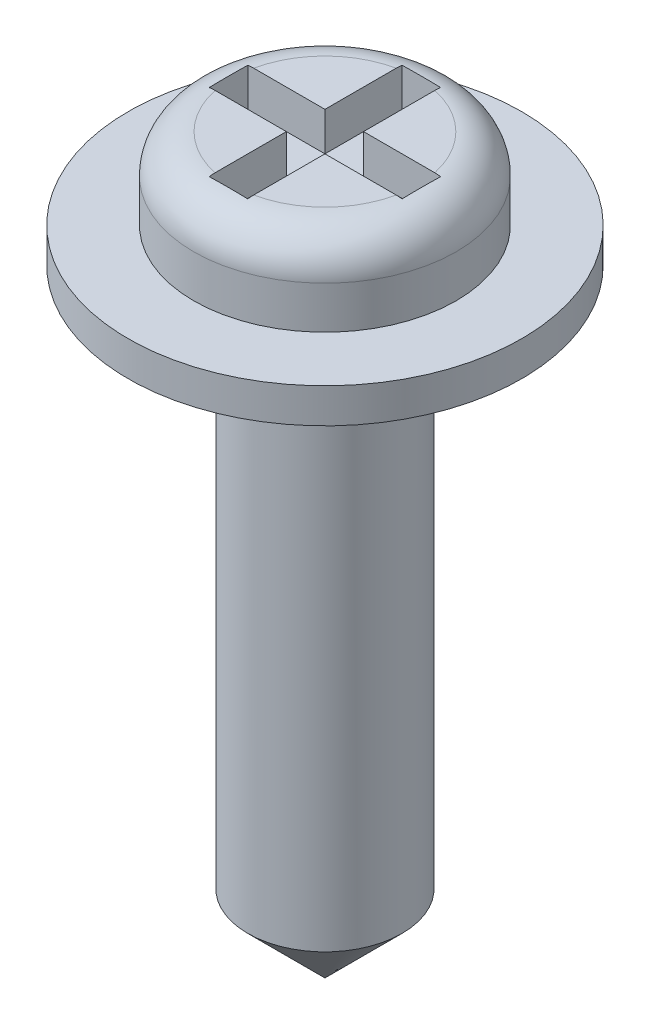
ISO-10303-21;
HEADER;
FILE_DESCRIPTION(('STEP AP214'),'2;1');
FILE_NAME('part.step','',(''),(''),'','','');
FILE_SCHEMA(('AUTOMOTIVE_DESIGN { 1 0 10303 214 1 1 1 1 }'));
ENDSEC;
DATA;
#1=APPLICATION_CONTEXT('core data for automotive mechanical design processes');
#2=APPLICATION_PROTOCOL_DEFINITION('international standard','automotive_design',2000,#1);
#3=PRODUCT_CONTEXT('',#1,'mechanical');
#4=PRODUCT('Part','Part','',(#3));
#5=PRODUCT_RELATED_PRODUCT_CATEGORY('part','',(#4));
#6=PRODUCT_DEFINITION_FORMATION('','',#4);
#7=PRODUCT_DEFINITION_CONTEXT('part definition',#1,'design');
#8=PRODUCT_DEFINITION('design','',#6,#7);
#9=PRODUCT_DEFINITION_SHAPE('','',#8);
#10=(LENGTH_UNIT() NAMED_UNIT(*) SI_UNIT(.MILLI.,.METRE.));
#11=(NAMED_UNIT(*) PLANE_ANGLE_UNIT() SI_UNIT($,.RADIAN.));
#12=(NAMED_UNIT(*) SI_UNIT($,.STERADIAN.) SOLID_ANGLE_UNIT());
#13=UNCERTAINTY_MEASURE_WITH_UNIT(LENGTH_MEASURE(1.E-05),#10,'distance_accuracy_value','');
#14=(GEOMETRIC_REPRESENTATION_CONTEXT(3) GLOBAL_UNCERTAINTY_ASSIGNED_CONTEXT((#13)) GLOBAL_UNIT_ASSIGNED_CONTEXT((#10,
#11,#12)) REPRESENTATION_CONTEXT('',''));
#15=CARTESIAN_POINT('',(0.,0.,0.));
#16=DIRECTION('',(0.,0.,1.));
#17=DIRECTION('',(1.,0.,0.));
#18=AXIS2_PLACEMENT_3D('',#15,#16,#17);
#19=CARTESIAN_POINT('',(0.,1.5,0.));
#20=DIRECTION('',(0.,-1.,0.));
#21=DIRECTION('',(0.,0.,-1.));
#22=AXIS2_PLACEMENT_3D('',#19,#20,#21);
#23=PLANE('',#22);
#24=CARTESIAN_POINT('',(0.,1.5,0.));
#25=DIRECTION('',(0.,-1.,0.));
#26=DIRECTION('',(0.,0.,-1.));
#27=AXIS2_PLACEMENT_3D('',#24,#25,#26);
#28=CIRCLE('',#27,1.2);
#29=CARTESIAN_POINT('',(-0.25,1.5,-1.17366945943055));
#30=VERTEX_POINT('',#29);
#31=CARTESIAN_POINT('',(-1.17366945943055,1.5,-0.25));
#32=VERTEX_POINT('',#31);
#33=EDGE_CURVE('E264',#30,#32,#28,.F.);
#34=ORIENTED_EDGE('',*,*,#33,.T.);
#35=DIRECTION('',(-1.,0.,0.));
#36=VECTOR('',#35,1.);
#37=CARTESIAN_POINT('',(-1.25,1.5,-0.25));
#38=LINE('',#37,#36);
#39=CARTESIAN_POINT('',(-0.25,1.5,-0.25));
#40=VERTEX_POINT('',#39);
#41=EDGE_CURVE('E172',#40,#32,#38,.T.);
#42=ORIENTED_EDGE('',*,*,#41,.F.);
#43=DIRECTION('',(0.,0.,1.));
#44=VECTOR('',#43,1.);
#45=CARTESIAN_POINT('',(-0.25,1.5,-0.25));
#46=LINE('',#45,#44);
#47=EDGE_CURVE('E174',#30,#40,#46,.T.);
#48=ORIENTED_EDGE('',*,*,#47,.F.);
#49=EDGE_LOOP('',(#34,#42,#48));
#50=FACE_BOUND('',#49,.T.);
#51=ADVANCED_FACE('F34',(#50),#23,.F.);
#52=CARTESIAN_POINT('',(1.17366945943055,1.5,-0.25));
#53=VERTEX_POINT('',#52);
#54=CARTESIAN_POINT('',(0.25,1.5,-1.17366945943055));
#55=VERTEX_POINT('',#54);
#56=EDGE_CURVE('E263',#53,#55,#28,.F.);
#57=ORIENTED_EDGE('',*,*,#56,.T.);
#58=DIRECTION('',(0.,0.,-1.));
#59=VECTOR('',#58,1.);
#60=CARTESIAN_POINT('',(0.25,1.5,-1.25));
#61=LINE('',#60,#59);
#62=CARTESIAN_POINT('',(0.25,1.5,-0.25));
#63=VERTEX_POINT('',#62);
#64=EDGE_CURVE('E212',#63,#55,#61,.T.);
#65=ORIENTED_EDGE('',*,*,#64,.F.);
#66=DIRECTION('',(-1.,0.,0.));
#67=VECTOR('',#66,1.);
#68=CARTESIAN_POINT('',(0.25,1.5,-0.25));
#69=LINE('',#68,#67);
#70=EDGE_CURVE('E210',#53,#63,#69,.T.);
#71=ORIENTED_EDGE('',*,*,#70,.F.);
#72=EDGE_LOOP('',(#57,#65,#71));
#73=FACE_BOUND('',#72,.T.);
#74=ADVANCED_FACE('F316',(#73),#23,.F.);
#75=CARTESIAN_POINT('',(0.25,1.5,1.17366945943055));
#76=VERTEX_POINT('',#75);
#77=CARTESIAN_POINT('',(1.17366945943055,1.5,0.25));
#78=VERTEX_POINT('',#77);
#79=EDGE_CURVE('E421',#76,#78,#28,.F.);
#80=ORIENTED_EDGE('',*,*,#79,.T.);
#81=DIRECTION('',(1.,0.,0.));
#82=VECTOR('',#81,1.);
#83=CARTESIAN_POINT('',(1.25,1.5,0.25));
#84=LINE('',#83,#82);
#85=CARTESIAN_POINT('',(0.25,1.5,0.25));
#86=VERTEX_POINT('',#85);
#87=EDGE_CURVE('E208',#86,#78,#84,.T.);
#88=ORIENTED_EDGE('',*,*,#87,.F.);
#89=DIRECTION('',(0.,0.,-1.));
#90=VECTOR('',#89,1.);
#91=CARTESIAN_POINT('',(0.25,1.5,0.25));
#92=LINE('',#91,#90);
#93=EDGE_CURVE('E206',#76,#86,#92,.T.);
#94=ORIENTED_EDGE('',*,*,#93,.F.);
#95=EDGE_LOOP('',(#80,#88,#94));
#96=FACE_BOUND('',#95,.T.);
#97=ADVANCED_FACE('F299',(#96),#23,.F.);
#98=CARTESIAN_POINT('',(-2.55,0.,0.));
#99=DIRECTION('',(0.,1.,0.));
#100=DIRECTION('',(0.,0.,1.));
#101=AXIS2_PLACEMENT_3D('',#98,#99,#100);
#102=PLANE('',#101);
#103=CARTESIAN_POINT('',(0.,0.,0.));
#104=DIRECTION('',(0.,-1.,0.));
#105=DIRECTION('',(0.,0.,-1.));
#106=AXIS2_PLACEMENT_3D('',#103,#104,#105);
#107=CIRCLE('',#106,1.);
#108=CARTESIAN_POINT('',(0.,0.,-1.));
#109=VERTEX_POINT('',#108);
#110=EDGE_CURVE('E217',#109,#109,#107,.T.);
#111=ORIENTED_EDGE('',*,*,#110,.F.);
#112=EDGE_LOOP('',(#111));
#113=FACE_BOUND('',#112,.T.);
#114=CARTESIAN_POINT('',(0.,0.,0.));
#115=DIRECTION('',(0.,-1.,0.));
#116=DIRECTION('',(0.,0.,-1.));
#117=AXIS2_PLACEMENT_3D('',#114,#115,#116);
#118=CIRCLE('',#117,2.55);
#119=CARTESIAN_POINT('',(0.,0.,-2.55));
#120=VERTEX_POINT('',#119);
#121=EDGE_CURVE('E257',#120,#120,#118,.T.);
#122=ORIENTED_EDGE('',*,*,#121,.T.);
#123=EDGE_LOOP('',(#122));
#124=FACE_BOUND('',#123,.T.);
#125=ADVANCED_FACE('F309',(#113,#124),#102,.F.);
#126=CARTESIAN_POINT('',(0.,0.,0.));
#127=DIRECTION('',(0.,-1.,0.));
#128=DIRECTION('',(0.,0.,-1.));
#129=AXIS2_PLACEMENT_3D('',#126,#127,#128);
#130=CYLINDRICAL_SURFACE('',#129,2.55);
#131=ORIENTED_EDGE('',*,*,#121,.F.);
#132=EDGE_LOOP('',(#131));
#133=FACE_BOUND('',#132,.T.);
#134=CARTESIAN_POINT('',(0.,0.45,0.));
#135=DIRECTION('',(0.,-1.,0.));
#136=DIRECTION('',(0.,0.,-1.));
#137=AXIS2_PLACEMENT_3D('',#134,#135,#136);
#138=CIRCLE('',#137,2.55);
#139=CARTESIAN_POINT('',(0.,0.45,-2.55));
#140=VERTEX_POINT('',#139);
#141=EDGE_CURVE('E254',#140,#140,#138,.T.);
#142=ORIENTED_EDGE('',*,*,#141,.T.);
#143=EDGE_LOOP('',(#142));
#144=FACE_BOUND('',#143,.T.);
#145=ADVANCED_FACE('F306',(#133,#144),#130,.T.);
#146=CARTESIAN_POINT('',(-1.7,0.45,0.));
#147=DIRECTION('',(0.,-1.,0.));
#148=DIRECTION('',(0.,0.,-1.));
#149=AXIS2_PLACEMENT_3D('',#146,#147,#148);
#150=PLANE('',#149);
#151=ORIENTED_EDGE('',*,*,#141,.F.);
#152=EDGE_LOOP('',(#151));
#153=FACE_BOUND('',#152,.T.);
#154=CARTESIAN_POINT('',(0.,0.45,0.));
#155=DIRECTION('',(0.,-1.,0.));
#156=DIRECTION('',(0.,0.,-1.));
#157=AXIS2_PLACEMENT_3D('',#154,#155,#156);
#158=CIRCLE('',#157,1.7);
#159=CARTESIAN_POINT('',(0.,0.45,-1.7));
#160=VERTEX_POINT('',#159);
#161=EDGE_CURVE('E251',#160,#160,#158,.T.);
#162=ORIENTED_EDGE('',*,*,#161,.T.);
#163=EDGE_LOOP('',(#162));
#164=FACE_BOUND('',#163,.T.);
#165=ADVANCED_FACE('F302',(#153,#164),#150,.F.);
#166=CARTESIAN_POINT('',(0.,0.,0.));
#167=DIRECTION('',(0.,-1.,0.));
#168=DIRECTION('',(0.,0.,-1.));
#169=AXIS2_PLACEMENT_3D('',#166,#167,#168);
#170=CYLINDRICAL_SURFACE('',#169,1.7);
#171=CARTESIAN_POINT('',(0.,1.,0.));
#172=DIRECTION('',(0.,-1.,0.));
#173=DIRECTION('',(0.,0.,-1.));
#174=AXIS2_PLACEMENT_3D('',#171,#172,#173);
#175=CIRCLE('',#174,1.7);
#176=CARTESIAN_POINT('',(0.,1.,-1.7));
#177=VERTEX_POINT('',#176);
#178=EDGE_CURVE('E260',#177,#177,#175,.T.);
#179=ORIENTED_EDGE('',*,*,#178,.T.);
#180=EDGE_LOOP('',(#179));
#181=FACE_BOUND('',#180,.T.);
#182=ORIENTED_EDGE('',*,*,#161,.F.);
#183=EDGE_LOOP('',(#182));
#184=FACE_BOUND('',#183,.T.);
#185=ADVANCED_FACE('F297',(#181,#184),#170,.T.);
#186=CARTESIAN_POINT('',(-1.17366945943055,1.5,0.25));
#187=VERTEX_POINT('',#186);
#188=CARTESIAN_POINT('',(-0.25,1.5,1.17366945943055));
#189=VERTEX_POINT('',#188);
#190=EDGE_CURVE('E268',#187,#189,#28,.F.);
#191=ORIENTED_EDGE('',*,*,#190,.T.);
#192=DIRECTION('',(0.,0.,1.));
#193=VECTOR('',#192,1.);
#194=CARTESIAN_POINT('',(-0.25,1.5,1.25));
#195=LINE('',#194,#193);
#196=CARTESIAN_POINT('',(-0.25,1.5,0.25));
#197=VERTEX_POINT('',#196);
#198=EDGE_CURVE('E204',#197,#189,#195,.T.);
#199=ORIENTED_EDGE('',*,*,#198,.F.);
#200=DIRECTION('',(1.,0.,0.));
#201=VECTOR('',#200,1.);
#202=CARTESIAN_POINT('',(-0.25,1.5,0.25));
#203=LINE('',#202,#201);
#204=EDGE_CURVE('E202',#187,#197,#203,.T.);
#205=ORIENTED_EDGE('',*,*,#204,.F.);
#206=EDGE_LOOP('',(#191,#199,#205));
#207=FACE_BOUND('',#206,.T.);
#208=ADVANCED_FACE('F294',(#207),#23,.F.);
#209=CARTESIAN_POINT('',(0.,-6.99999999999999,0.));
#210=DIRECTION('',(0.,1.,0.));
#211=DIRECTION('',(0.,0.,1.));
#212=AXIS2_PLACEMENT_3D('',#209,#210,#211);
#213=CONICAL_SURFACE('',#212,0.999999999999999,0.785398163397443);
#214=CARTESIAN_POINT('',(0.,-8.,0.));
#215=VERTEX_POINT('',#214);
#216=VERTEX_LOOP('',#215);
#217=FACE_BOUND('',#216,.T.);
#218=CARTESIAN_POINT('',(0.,-6.99999999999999,0.));
#219=DIRECTION('',(0.,-1.,0.));
#220=DIRECTION('',(0.,0.,-1.));
#221=AXIS2_PLACEMENT_3D('',#218,#219,#220);
#222=CIRCLE('',#221,0.999999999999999);
#223=CARTESIAN_POINT('',(0.,-6.99999999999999,-0.999999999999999));
#224=VERTEX_POINT('',#223);
#225=EDGE_CURVE('E248',#224,#224,#222,.T.);
#226=ORIENTED_EDGE('',*,*,#225,.T.);
#227=EDGE_LOOP('',(#226));
#228=FACE_BOUND('',#227,.T.);
#229=ADVANCED_FACE('F290',(#217,#228),#213,.T.);
#230=CARTESIAN_POINT('',(0.,0.,0.));
#231=DIRECTION('',(0.,-1.,0.));
#232=DIRECTION('',(0.,0.,-1.));
#233=AXIS2_PLACEMENT_3D('',#230,#231,#232);
#234=CYLINDRICAL_SURFACE('',#233,1.);
#235=ORIENTED_EDGE('',*,*,#225,.F.);
#236=EDGE_LOOP('',(#235));
#237=FACE_BOUND('',#236,.T.);
#238=ORIENTED_EDGE('',*,*,#110,.T.);
#239=EDGE_LOOP('',(#238));
#240=FACE_BOUND('',#239,.T.);
#241=ADVANCED_FACE('F287',(#237,#240),#234,.T.);
#242=CARTESIAN_POINT('',(0.,1.,0.));
#243=DIRECTION('',(0.,-1.,0.));
#244=DIRECTION('',(0.,0.,-1.));
#245=AXIS2_PLACEMENT_3D('',#242,#243,#244);
#246=TOROIDAL_SURFACE('',#245,1.2,0.5);
#247=CARTESIAN_POINT('',(-0.25,1.49611475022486,-1.10998414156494));
#248=CARTESIAN_POINT('',(-0.25,1.4924995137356,-1.08044209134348));
#249=CARTESIAN_POINT('',(-0.25,1.4863695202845,-1.05118381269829));
#250=CARTESIAN_POINT('',(-0.25,1.46928093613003,-0.994082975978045));
#251=CARTESIAN_POINT('',(-0.25,1.458315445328,-0.966242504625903));
#252=CARTESIAN_POINT('',(-0.25,1.43188553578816,-0.91280399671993));
#253=CARTESIAN_POINT('',(-0.25,1.41642396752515,-0.88720455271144));
#254=CARTESIAN_POINT('',(-0.25,1.38141866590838,-0.83897372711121));
#255=CARTESIAN_POINT('',(-0.25,1.36187581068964,-0.816341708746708));
#256=CARTESIAN_POINT('',(-0.25,1.31926234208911,-0.774792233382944));
#257=CARTESIAN_POINT('',(-0.25,1.29620049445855,-0.755865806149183));
#258=CARTESIAN_POINT('',(-0.25,1.24711767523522,-0.722334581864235));
#259=CARTESIAN_POINT('',(-0.25,1.2210972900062,-0.707728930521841));
#260=CARTESIAN_POINT('',(-0.25,1.16790414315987,-0.683938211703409));
#261=CARTESIAN_POINT('',(-0.25,1.14081668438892,-0.674562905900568));
#262=CARTESIAN_POINT('',(-0.25,1.08540291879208,-0.660824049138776));
#263=CARTESIAN_POINT('',(-0.25,1.05707727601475,-0.656457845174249));
#264=CARTESIAN_POINT('',(-0.25,1.00181548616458,-0.653068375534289));
#265=CARTESIAN_POINT('',(-0.25,0.974897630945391,-0.653740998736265));
#266=CARTESIAN_POINT('',(-0.25,0.921576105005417,-0.659679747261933));
#267=CARTESIAN_POINT('',(-0.25,0.895172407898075,-0.664945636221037));
#268=CARTESIAN_POINT('',(-0.25,0.844038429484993,-0.679706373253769));
#269=CARTESIAN_POINT('',(-0.25,0.819288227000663,-0.689132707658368));
#270=CARTESIAN_POINT('',(-0.25,0.771617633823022,-0.71182393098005));
#271=CARTESIAN_POINT('',(-0.25,0.748697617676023,-0.725089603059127));
#272=CARTESIAN_POINT('',(-0.25,0.704187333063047,-0.755716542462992));
#273=CARTESIAN_POINT('',(-0.25,0.682708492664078,-0.773239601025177));
#274=CARTESIAN_POINT('',(-0.25,0.642800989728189,-0.811469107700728));
#275=CARTESIAN_POINT('',(-0.25,0.624373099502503,-0.832176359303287));
#276=CARTESIAN_POINT('',(-0.25,0.590056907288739,-0.877433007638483));
#277=CARTESIAN_POINT('',(-0.25,0.574364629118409,-0.90213128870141));
#278=CARTESIAN_POINT('',(-0.25,0.54723719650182,-0.953766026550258));
#279=CARTESIAN_POINT('',(-0.25,0.535802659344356,-0.98070280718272));
#280=CARTESIAN_POINT('',(-0.25,0.517297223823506,-1.0367321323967));
#281=CARTESIAN_POINT('',(-0.25,0.510333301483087,-1.06586011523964));
#282=CARTESIAN_POINT('',(-0.25,0.501429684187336,-1.12487567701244));
#283=CARTESIAN_POINT('',(-0.25,0.499489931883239,-1.154763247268));
#284=CARTESIAN_POINT('',(-0.25,0.500734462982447,-1.21423104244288));
#285=CARTESIAN_POINT('',(-0.25,0.503884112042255,-1.2438119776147));
#286=CARTESIAN_POINT('',(-0.25,0.515202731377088,-1.30199866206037));
#287=CARTESIAN_POINT('',(-0.25,0.523371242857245,-1.3306045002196));
#288=CARTESIAN_POINT('',(-0.25,0.544332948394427,-1.3854535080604));
#289=CARTESIAN_POINT('',(-0.25,0.557036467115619,-1.41173094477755));
#290=CARTESIAN_POINT('',(-0.25,0.586755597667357,-1.46172316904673));
#291=CARTESIAN_POINT('',(-0.25,0.603770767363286,-1.48543821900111));
#292=CARTESIAN_POINT('',(-0.25,0.64128412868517,-1.52916649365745));
#293=CARTESIAN_POINT('',(-0.25,0.661711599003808,-1.54924040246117));
#294=CARTESIAN_POINT('',(-0.25,0.705688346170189,-1.58561440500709));
#295=CARTESIAN_POINT('',(-0.25,0.729237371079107,-1.60191480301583));
#296=CARTESIAN_POINT('',(-0.25,0.778431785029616,-1.63004590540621));
#297=CARTESIAN_POINT('',(-0.25,0.804043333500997,-1.64193580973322));
#298=CARTESIAN_POINT('',(-0.25,0.856910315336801,-1.66120542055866));
#299=CARTESIAN_POINT('',(-0.25,0.884165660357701,-1.66858536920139));
#300=CARTESIAN_POINT('',(-0.25,0.939299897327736,-1.67857002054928));
#301=CARTESIAN_POINT('',(-0.25,0.967171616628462,-1.68121436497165));
#302=CARTESIAN_POINT('',(-0.25,1.02296196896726,-1.68177076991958));
#303=CARTESIAN_POINT('',(-0.25,1.0508806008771,-1.67968294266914));
#304=CARTESIAN_POINT('',(-0.25,1.10588483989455,-1.67085085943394));
#305=CARTESIAN_POINT('',(-0.25,1.13297269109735,-1.66412056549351));
#306=CARTESIAN_POINT('',(-0.25,1.18563768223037,-1.64621765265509));
#307=CARTESIAN_POINT('',(-0.25,1.21121481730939,-1.63504501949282));
#308=CARTESIAN_POINT('',(-0.25,1.26019936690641,-1.60855575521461));
#309=CARTESIAN_POINT('',(-0.25,1.28360170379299,-1.59322973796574));
#310=CARTESIAN_POINT('',(-0.25,1.32752424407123,-1.5588941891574));
#311=CARTESIAN_POINT('',(-0.25,1.34804449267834,-1.53988471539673));
#312=CARTESIAN_POINT('',(-0.25,1.38579182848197,-1.4985771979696));
#313=CARTESIAN_POINT('',(-0.25,1.40299332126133,-1.47625577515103));
#314=CARTESIAN_POINT('',(-0.25,1.43346387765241,-1.42906592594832));
#315=CARTESIAN_POINT('',(-0.25,1.44673174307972,-1.40419672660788));
#316=CARTESIAN_POINT('',(-0.25,1.46914807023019,-1.3522752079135));
#317=CARTESIAN_POINT('',(-0.25,1.47823919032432,-1.32519818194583));
#318=CARTESIAN_POINT('',(-0.25,1.49182089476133,-1.26993874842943));
#319=CARTESIAN_POINT('',(-0.25,1.49631665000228,-1.24175762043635));
#320=CARTESIAN_POINT('',(-0.25,1.49980162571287,-1.19619284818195));
#321=CARTESIAN_POINT('',(-0.25,1.50025874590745,-1.17890800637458));
#322=CARTESIAN_POINT('',(-0.25,1.49946463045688,-1.14437828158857));
#323=CARTESIAN_POINT('',(-0.25,1.49821340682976,-1.12713339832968));
#324=CARTESIAN_POINT('',(-0.25,1.49611475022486,-1.10998414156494));
#325=B_SPLINE_CURVE_WITH_KNOTS('',3,(#247,#248,#249,#250,#251,#252,#253,#254,#255,#256,#257,
#258,#259,#260,#261,#262,#263,#264,#265,#266,#267,#268,#269,#270,#271,#272,#273,#274,#275,#276,
#277,#278,#279,#280,#281,#282,#283,#284,#285,#286,#287,#288,#289,#290,#291,#292,#293,#294,#295,
#296,#297,#298,#299,#300,#301,#302,#303,#304,#305,#306,#307,#308,#309,#310,#311,#312,#313,#314,
#315,#316,#317,#318,#319,#320,#321,#322,#323,#324),.UNSPECIFIED.,.T.,.F.,(4,2,2,2,2,2,2,2,2,2,2,
2,2,2,2,2,2,2,2,2,2,2,2,2,2,2,2,2,2,2,2,2,2,2,2,2,2,2,4),(0.,0.0892237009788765,
0.178575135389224,0.26787004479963,0.357145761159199,0.446202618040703,0.535241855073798,
0.620786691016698,0.706286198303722,0.786668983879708,0.867047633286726,0.94614932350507,
1.02526716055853,1.10806479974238,1.19088336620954,1.27826786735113,1.36566503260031,
1.45508240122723,1.54449874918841,1.63330916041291,1.72211145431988,1.80924707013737,
1.89637375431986,1.98187881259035,2.06737697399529,2.15168201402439,2.23598252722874,
2.31957400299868,2.40316349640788,2.48650268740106,2.56984214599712,2.65337153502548,
2.73689961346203,2.82104815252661,2.90522229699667,2.99051984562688,3.07572130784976,
3.12751632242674,3.17931097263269),.UNSPECIFIED.);
#326=CARTESIAN_POINT('',(-0.25,1.49438012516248,-1.25));
#327=VERTEX_POINT('',#326);
#328=EDGE_CURVE('E11',#327,#30,#325,.T.);
#329=ORIENTED_EDGE('',*,*,#328,.F.);
#330=CARTESIAN_POINT('',(0.,1.49749371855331,-1.25));
#331=CARTESIAN_POINT('',(-0.0431001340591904,1.49748890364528,-1.25));
#332=CARTESIAN_POINT('',(-0.0862003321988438,1.49728299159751,-1.25));
#333=CARTESIAN_POINT('',(-0.172393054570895,1.49627343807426,-1.25));
#334=CARTESIAN_POINT('',(-0.21548557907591,1.49546982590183,-1.25));
#335=CARTESIAN_POINT('',(-0.301498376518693,1.49277263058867,-1.25));
#336=CARTESIAN_POINT('',(-0.344418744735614,1.49088269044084,-1.25));
#337=CARTESIAN_POINT('',(-0.430126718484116,1.485236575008,-1.25));
#338=CARTESIAN_POINT('',(-0.472914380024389,1.48148134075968,-1.25));
#339=CARTESIAN_POINT('',(-0.565503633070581,1.47020811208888,-1.25));
#340=CARTESIAN_POINT('',(-0.61524549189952,1.46215392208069,-1.25));
#341=CARTESIAN_POINT('',(-0.713480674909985,1.44011766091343,-1.25));
#342=CARTESIAN_POINT('',(-0.76197512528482,1.42614115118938,-1.25));
#343=CARTESIAN_POINT('',(-0.84068668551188,1.39586248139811,-1.25));
#344=CARTESIAN_POINT('',(-0.87174137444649,1.38177541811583,-1.25));
#345=CARTESIAN_POINT('',(-0.93145072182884,1.34915630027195,-1.25));
#346=CARTESIAN_POINT('',(-0.960108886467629,1.33063089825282,-1.25));
#347=CARTESIAN_POINT('',(-1.00671300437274,1.29401656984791,-1.25));
#348=CARTESIAN_POINT('',(-1.02552192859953,1.2770327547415,-1.25));
#349=CARTESIAN_POINT('',(-1.06019866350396,1.24027490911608,-1.25));
#350=CARTESIAN_POINT('',(-1.07607005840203,1.22050433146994,-1.25));
#351=CARTESIAN_POINT('',(-1.10154015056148,1.18202419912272,-1.25));
#352=CARTESIAN_POINT('',(-1.11174862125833,1.16371996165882,-1.25));
#353=CARTESIAN_POINT('',(-1.12898477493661,1.12566087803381,-1.25));
#354=CARTESIAN_POINT('',(-1.13601395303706,1.10590671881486,-1.25));
#355=CARTESIAN_POINT('',(-1.14647488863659,1.06535234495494,-1.25));
#356=CARTESIAN_POINT('',(-1.14988871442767,1.0445474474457,-1.25));
#357=CARTESIAN_POINT('',(-1.15280939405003,1.00266435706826,-1.25));
#358=CARTESIAN_POINT('',(-1.1523171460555,0.981586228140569,-1.25));
#359=CARTESIAN_POINT('',(-1.14767304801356,0.941651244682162,-1.25));
#360=CARTESIAN_POINT('',(-1.14383331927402,0.922756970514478,-1.25));
#361=CARTESIAN_POINT('',(-1.13314544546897,0.885849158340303,-1.25));
#362=CARTESIAN_POINT('',(-1.12629748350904,0.86783556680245,-1.25));
#363=CARTESIAN_POINT('',(-1.10964781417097,0.832421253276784,-1.25));
#364=CARTESIAN_POINT('',(-1.09974611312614,0.815067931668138,-1.25));
#365=CARTESIAN_POINT('',(-1.07755613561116,0.781964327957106,-1.25));
#366=CARTESIAN_POINT('',(-1.06526594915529,0.766215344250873,-1.25));
#367=CARTESIAN_POINT('',(-1.03225778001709,0.729143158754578,-1.25));
#368=CARTESIAN_POINT('',(-1.01036024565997,0.708867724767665,-1.25));
#369=CARTESIAN_POINT('',(-0.963622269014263,0.672110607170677,-1.25));
#370=CARTESIAN_POINT('',(-0.938777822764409,0.655634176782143,-1.25));
#371=CARTESIAN_POINT('',(-0.873268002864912,0.618203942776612,-1.25));
#372=CARTESIAN_POINT('',(-0.831267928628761,0.599593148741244,-1.25));
#373=CARTESIAN_POINT('',(-0.766603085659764,0.576548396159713,-1.25));
#374=CARTESIAN_POINT('',(-0.744722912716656,0.569669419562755,-1.25));
#375=CARTESIAN_POINT('',(-0.700574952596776,0.557326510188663,-1.25));
#376=CARTESIAN_POINT('',(-0.678307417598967,0.551861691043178,-1.25));
#377=CARTESIAN_POINT('',(-0.616947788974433,0.538539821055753,-1.25));
#378=CARTESIAN_POINT('',(-0.577594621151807,0.53190342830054,-1.25));
#379=CARTESIAN_POINT('',(-0.498522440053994,0.521278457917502,-1.25));
#380=CARTESIAN_POINT('',(-0.458803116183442,0.517292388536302,-1.25));
#381=CARTESIAN_POINT('',(-0.379084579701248,0.511118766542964,-1.25));
#382=CARTESIAN_POINT('',(-0.339084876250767,0.50893803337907,-1.25));
#383=CARTESIAN_POINT('',(-0.259059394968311,0.50571460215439,-1.25));
#384=CARTESIAN_POINT('',(-0.21903363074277,0.504671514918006,-1.25));
#385=CARTESIAN_POINT('',(-0.13860577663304,0.503228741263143,-1.25));
#386=CARTESIAN_POINT('',(-0.0982035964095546,0.502835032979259,-1.25));
#387=CARTESIAN_POINT('',(-0.0173940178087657,0.502449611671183,-1.25));
#388=CARTESIAN_POINT('',(0.023013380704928,0.50245793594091,-1.25));
#389=CARTESIAN_POINT('',(0.103743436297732,0.50288262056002,-1.25));
#390=CARTESIAN_POINT('',(0.144066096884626,0.503298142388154,-1.25));
#391=CARTESIAN_POINT('',(0.224696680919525,0.504805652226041,-1.25));
#392=CARTESIAN_POINT('',(0.265004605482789,0.505897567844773,-1.25));
#393=CARTESIAN_POINT('',(0.345321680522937,0.509254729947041,-1.25));
#394=CARTESIAN_POINT('',(0.385331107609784,0.511512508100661,-1.25));
#395=CARTESIAN_POINT('',(0.465245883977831,0.517896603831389,-1.25));
#396=CARTESIAN_POINT('',(0.505151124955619,0.522024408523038,-1.25));
#397=CARTESIAN_POINT('',(0.584178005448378,0.532958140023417,-1.25));
#398=CARTESIAN_POINT('',(0.623303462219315,0.539734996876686,-1.25));
#399=CARTESIAN_POINT('',(0.700722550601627,0.556944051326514,-1.25));
#400=CARTESIAN_POINT('',(0.739017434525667,0.56737027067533,-1.25));
#401=CARTESIAN_POINT('',(0.804325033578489,0.589662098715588,-1.25));
#402=CARTESIAN_POINT('',(0.83169695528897,0.600460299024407,-1.25));
#403=CARTESIAN_POINT('',(0.885114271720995,0.625165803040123,-1.25));
#404=CARTESIAN_POINT('',(0.911156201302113,0.639080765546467,-1.25));
#405=CARTESIAN_POINT('',(0.961301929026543,0.670569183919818,-1.25));
#406=CARTESIAN_POINT('',(0.985385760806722,0.688175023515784,-1.25));
#407=CARTESIAN_POINT('',(1.03020153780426,0.727226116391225,-1.25));
#408=CARTESIAN_POINT('',(1.05094168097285,0.748661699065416,-1.25));
#409=CARTESIAN_POINT('',(1.08264419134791,0.788872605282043,-1.25));
#410=CARTESIAN_POINT('',(1.09472772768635,0.806762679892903,-1.25));
#411=CARTESIAN_POINT('',(1.11581847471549,0.844288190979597,-1.25));
#412=CARTESIAN_POINT('',(1.12482698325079,0.863922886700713,-1.25));
#413=CARTESIAN_POINT('',(1.13926058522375,0.904625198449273,-1.25));
#414=CARTESIAN_POINT('',(1.14466245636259,0.925701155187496,-1.25));
#415=CARTESIAN_POINT('',(1.15139142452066,0.968495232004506,-1.25));
#416=CARTESIAN_POINT('',(1.15272048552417,0.990213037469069,-1.25));
#417=CARTESIAN_POINT('',(1.15128523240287,1.03129846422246,-1.25));
#418=CARTESIAN_POINT('',(1.1489218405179,1.05068135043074,-1.25));
#419=CARTESIAN_POINT('',(1.14098041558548,1.08876980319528,-1.25));
#420=CARTESIAN_POINT('',(1.13540262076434,1.10747541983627,-1.25));
#421=CARTESIAN_POINT('',(1.12132238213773,1.14382742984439,-1.25));
#422=CARTESIAN_POINT('',(1.11280808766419,1.16146918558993,-1.25));
#423=CARTESIAN_POINT('',(1.0932813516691,1.19530370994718,-1.25));
#424=CARTESIAN_POINT('',(1.0822675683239,1.21149569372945,-1.25));
#425=CARTESIAN_POINT('',(1.05302574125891,1.24884127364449,-1.25));
#426=CARTESIAN_POINT('',(1.03372626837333,1.26915746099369,-1.25));
#427=CARTESIAN_POINT('',(0.992106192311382,1.30639799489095,-1.25));
#428=CARTESIAN_POINT('',(0.96978016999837,1.32331611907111,-1.25));
#429=CARTESIAN_POINT('',(0.911839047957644,1.36130954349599,-1.25));
#430=CARTESIAN_POINT('',(0.874986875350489,1.38048566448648,-1.25));
#431=CARTESIAN_POINT('',(0.7988387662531,1.41298919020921,-1.25));
#432=CARTESIAN_POINT('',(0.759538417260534,1.426305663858,-1.25));
#433=CARTESIAN_POINT('',(0.661779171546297,1.45333873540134,-1.25));
#434=CARTESIAN_POINT('',(0.602649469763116,1.46454436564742,-1.25));
#435=CARTESIAN_POINT('',(0.483507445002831,1.48091008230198,-1.25));
#436=CARTESIAN_POINT('',(0.423492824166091,1.48604973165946,-1.25));
#437=CARTESIAN_POINT('',(0.302863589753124,1.49304991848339,-1.25));
#438=CARTESIAN_POINT('',(0.242247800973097,1.49488616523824,-1.25));
#439=CARTESIAN_POINT('',(0.121088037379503,1.49711042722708,-1.25));
#440=CARTESIAN_POINT('',(0.060544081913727,1.4975004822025,-1.25));
#441=CARTESIAN_POINT('',(0.,1.49749371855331,-1.25));
#442=B_SPLINE_CURVE_WITH_KNOTS('',3,(#330,#331,#332,#333,#334,#335,#336,#337,#338,#339,#340,
#341,#342,#343,#344,#345,#346,#347,#348,#349,#350,#351,#352,#353,#354,#355,#356,#357,#358,#359,
#360,#361,#362,#363,#364,#365,#366,#367,#368,#369,#370,#371,#372,#373,#374,#375,#376,#377,#378,
#379,#380,#381,#382,#383,#384,#385,#386,#387,#388,#389,#390,#391,#392,#393,#394,#395,#396,#397,
#398,#399,#400,#401,#402,#403,#404,#405,#406,#407,#408,#409,#410,#411,#412,#413,#414,#415,#416,
#417,#418,#419,#420,#421,#422,#423,#424,#425,#426,#427,#428,#429,#430,#431,#432,#433,#434,#435,
#436,#437,#438,#439,#440,#441),.UNSPECIFIED.,.T.,.F.,(4,2,2,2,2,2,2,2,2,2,2,2,2,2,2,2,2,2,2,2,2,
2,2,2,2,2,2,2,2,2,2,2,2,2,2,2,2,2,2,2,2,2,2,2,2,2,2,2,2,2,2,2,2,2,2,4),(0.,0.129299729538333,
0.258593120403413,0.387455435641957,0.516252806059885,0.667208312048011,0.81802237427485,
0.920047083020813,1.02191981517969,1.09768198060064,1.17335108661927,1.23596667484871,
1.29855278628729,1.36144788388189,1.42432851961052,1.48190632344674,1.53948062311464,
1.59918705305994,1.65894142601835,1.7479621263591,1.83710519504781,1.97409155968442,
2.04287460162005,2.11161442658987,2.23120209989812,2.35090278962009,2.47105359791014,
2.59116329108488,2.71237265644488,2.833593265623,2.9545647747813,3.07552333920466,
3.19571650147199,3.31600541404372,3.43500978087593,3.55382010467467,3.64194192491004,
3.73028270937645,3.81943372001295,3.90836271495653,3.97287763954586,4.03736530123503,
4.10226427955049,4.16713195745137,4.22543020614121,4.28372413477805,4.34225612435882,
4.40081961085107,4.48441444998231,4.5681609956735,4.69208292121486,4.81623505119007,
4.99619599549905,5.17676153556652,5.35864947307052,5.5402807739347),.UNSPECIFIED.);
#443=CARTESIAN_POINT('',(0.25,1.49438012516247,-1.25));
#444=VERTEX_POINT('',#443);
#445=EDGE_CURVE('E46',#444,#327,#442,.T.);
#446=ORIENTED_EDGE('',*,*,#445,.F.);
#447=CARTESIAN_POINT('',(0.25,1.49611475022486,-1.10998414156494));
#448=CARTESIAN_POINT('',(0.25,1.49965190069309,-1.13890860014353));
#449=CARTESIAN_POINT('',(0.25,1.50078390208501,-1.16814711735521));
#450=CARTESIAN_POINT('',(0.25,1.49814749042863,-1.22642612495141));
#451=CARTESIAN_POINT('',(0.25,1.49437395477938,-1.25546637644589));
#452=CARTESIAN_POINT('',(0.25,1.48197552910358,-1.31250817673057));
#453=CARTESIAN_POINT('',(0.25,1.47334894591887,-1.34050935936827));
#454=CARTESIAN_POINT('',(0.25,1.45144817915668,-1.39462522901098));
#455=CARTESIAN_POINT('',(0.25,1.4381752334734,-1.42074041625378));
#456=CARTESIAN_POINT('',(0.25,1.40755951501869,-1.46993955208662));
#457=CARTESIAN_POINT('',(0.25,1.39027866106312,-1.49306202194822));
#458=CARTESIAN_POINT('',(0.25,1.35202084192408,-1.53601688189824));
#459=CARTESIAN_POINT('',(0.25,1.33104407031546,-1.55584944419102));
#460=CARTESIAN_POINT('',(0.25,1.28636116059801,-1.59132531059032));
#461=CARTESIAN_POINT('',(0.25,1.26270483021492,-1.60703136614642));
#462=CARTESIAN_POINT('',(0.25,1.21306841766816,-1.63419773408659));
#463=CARTESIAN_POINT('',(0.25,1.18708849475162,-1.64565833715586));
#464=CARTESIAN_POINT('',(0.25,1.1338477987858,-1.66388604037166));
#465=CARTESIAN_POINT('',(0.25,1.10660403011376,-1.67070283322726));
#466=CARTESIAN_POINT('',(0.25,1.05135686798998,-1.67963836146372));
#467=CARTESIAN_POINT('',(0.25,1.02335350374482,-1.6817572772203));
#468=CARTESIAN_POINT('',(0.25,0.96754220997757,-1.68123517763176));
#469=CARTESIAN_POINT('',(0.25,0.939734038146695,-1.67861964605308));
#470=CARTESIAN_POINT('',(0.25,0.884952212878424,-1.66875628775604));
#471=CARTESIAN_POINT('',(0.25,0.857978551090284,-1.66150850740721));
#472=CARTESIAN_POINT('',(0.25,0.805629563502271,-1.64259599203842));
#473=CARTESIAN_POINT('',(0.25,0.780254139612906,-1.63093152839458));
#474=CARTESIAN_POINT('',(0.25,0.731808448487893,-1.60352892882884));
#475=CARTESIAN_POINT('',(0.25,0.708738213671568,-1.58779073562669));
#476=CARTESIAN_POINT('',(0.25,0.665423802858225,-1.55260760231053));
#477=CARTESIAN_POINT('',(0.25,0.645194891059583,-1.53314387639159));
#478=CARTESIAN_POINT('',(0.25,0.608251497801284,-1.49112776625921));
#479=CARTESIAN_POINT('',(0.25,0.591537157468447,-1.46857525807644));
#480=CARTESIAN_POINT('',(0.25,0.561901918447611,-1.42077343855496));
#481=CARTESIAN_POINT('',(0.25,0.549022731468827,-1.39549827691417));
#482=CARTESIAN_POINT('',(0.25,0.527617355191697,-1.34316871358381));
#483=CARTESIAN_POINT('',(0.25,0.51909145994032,-1.31611419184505));
#484=CARTESIAN_POINT('',(0.25,0.506485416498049,-1.26054315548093));
#485=CARTESIAN_POINT('',(0.25,0.502477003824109,-1.23201037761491));
#486=CARTESIAN_POINT('',(0.25,0.499210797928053,-1.17467505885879));
#487=CARTESIAN_POINT('',(0.25,0.49995346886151,-1.14587249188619));
#488=CARTESIAN_POINT('',(0.25,0.506185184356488,-1.08822600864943));
#489=CARTESIAN_POINT('',(0.25,0.51176505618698,-1.05939190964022));
#490=CARTESIAN_POINT('',(0.25,0.52760388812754,-1.00303802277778));
#491=CARTESIAN_POINT('',(0.25,0.537863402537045,-0.975518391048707));
#492=CARTESIAN_POINT('',(0.25,0.562976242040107,-0.922095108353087));
#493=CARTESIAN_POINT('',(0.25,0.577903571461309,-0.896226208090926));
#494=CARTESIAN_POINT('',(0.25,0.611889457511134,-0.847354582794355));
#495=CARTESIAN_POINT('',(0.25,0.630948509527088,-0.824352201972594));
#496=CARTESIAN_POINT('',(0.25,0.672696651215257,-0.781929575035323));
#497=CARTESIAN_POINT('',(0.25,0.695384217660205,-0.762507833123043));
#498=CARTESIAN_POINT('',(0.25,0.743802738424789,-0.727916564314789));
#499=CARTESIAN_POINT('',(0.25,0.769533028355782,-0.712746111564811));
#500=CARTESIAN_POINT('',(0.25,0.822321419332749,-0.687758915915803));
#501=CARTESIAN_POINT('',(0.25,0.849295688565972,-0.677765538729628));
#502=CARTESIAN_POINT('',(0.25,0.904596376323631,-0.662781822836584));
#503=CARTESIAN_POINT('',(0.25,0.932922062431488,-0.657788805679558));
#504=CARTESIAN_POINT('',(0.25,0.988283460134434,-0.653207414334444));
#505=CARTESIAN_POINT('',(0.25,1.01529404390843,-0.653311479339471));
#506=CARTESIAN_POINT('',(0.25,1.06889323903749,-0.65815820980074));
#507=CARTESIAN_POINT('',(0.25,1.09548188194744,-0.662900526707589));
#508=CARTESIAN_POINT('',(0.25,1.14695073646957,-0.676658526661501));
#509=CARTESIAN_POINT('',(0.25,1.17185447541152,-0.68558688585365));
#510=CARTESIAN_POINT('',(0.25,1.21990328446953,-0.70732285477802));
#511=CARTESIAN_POINT('',(0.25,1.24304807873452,-0.720131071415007));
#512=CARTESIAN_POINT('',(0.25,1.2880234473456,-0.74983189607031));
#513=CARTESIAN_POINT('',(0.25,1.30975188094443,-0.766878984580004));
#514=CARTESIAN_POINT('',(0.25,1.35023960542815,-0.804203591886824));
#515=CARTESIAN_POINT('',(0.25,1.36899742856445,-0.824482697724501));
#516=CARTESIAN_POINT('',(0.25,1.40409037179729,-0.868943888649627));
#517=CARTESIAN_POINT('',(0.25,1.42022778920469,-0.893282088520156));
#518=CARTESIAN_POINT('',(0.25,1.44829183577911,-0.944251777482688));
#519=CARTESIAN_POINT('',(0.25,1.4602226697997,-0.970880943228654));
#520=CARTESIAN_POINT('',(0.25,1.47626861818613,-1.01636192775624));
#521=CARTESIAN_POINT('',(0.25,1.48166168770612,-1.03477342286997));
#522=CARTESIAN_POINT('',(0.25,1.49042157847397,-1.07207270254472));
#523=CARTESIAN_POINT('',(0.25,1.49378836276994,-1.0909604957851));
#524=CARTESIAN_POINT('',(0.25,1.49611475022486,-1.10998414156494));
#525=B_SPLINE_CURVE_WITH_KNOTS('',3,(#447,#448,#449,#450,#451,#452,#453,#454,#455,#456,#457,
#458,#459,#460,#461,#462,#463,#464,#465,#466,#467,#468,#469,#470,#471,#472,#473,#474,#475,#476,
#477,#478,#479,#480,#481,#482,#483,#484,#485,#486,#487,#488,#489,#490,#491,#492,#493,#494,#495,
#496,#497,#498,#499,#500,#501,#502,#503,#504,#505,#506,#507,#508,#509,#510,#511,#512,#513,#514,
#515,#516,#517,#518,#519,#520,#521,#522,#523,#524),.UNSPECIFIED.,.T.,.F.,(4,2,2,2,2,2,2,2,2,2,2,
2,2,2,2,2,2,2,2,2,2,2,2,2,2,2,2,2,2,2,2,2,2,2,2,2,2,2,4),(0.,0.0873515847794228,
0.174794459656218,0.262267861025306,0.349717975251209,0.435897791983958,0.52207309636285,
0.606850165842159,0.691621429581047,0.775470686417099,0.859316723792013,0.942712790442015,
1.02610802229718,1.10949813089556,1.19288941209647,1.2767128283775,1.36053960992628,
1.44524733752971,1.52996078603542,1.61600128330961,1.70205018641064,1.78975069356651,
1.87746159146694,1.96664033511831,2.05582977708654,2.14498187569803,2.23411454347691,
2.31996371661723,2.40576687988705,2.48639940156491,2.56702586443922,2.64604052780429,
2.72506755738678,2.80756013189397,2.89009333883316,2.97730674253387,3.06443271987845,
3.12188289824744,3.17933412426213),.UNSPECIFIED.);
#526=EDGE_CURVE('E364',#55,#444,#525,.T.);
#527=ORIENTED_EDGE('',*,*,#526,.F.);
#528=ORIENTED_EDGE('',*,*,#56,.F.);
#529=CARTESIAN_POINT('',(0.667925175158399,1.11404010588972,-0.25));
#530=CARTESIAN_POINT('',(0.661505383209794,1.08836817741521,-0.25));
#531=CARTESIAN_POINT('',(0.657230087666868,1.06214348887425,-0.25));
#532=CARTESIAN_POINT('',(0.653177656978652,1.00933455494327,-0.25));
#533=CARTESIAN_POINT('',(0.653403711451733,0.982750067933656,-0.25));
#534=CARTESIAN_POINT('',(0.658345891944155,0.930022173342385,-0.25));
#535=CARTESIAN_POINT('',(0.663058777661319,0.903878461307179,-0.25));
#536=CARTESIAN_POINT('',(0.676753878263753,0.852740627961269,-0.25));
#537=CARTESIAN_POINT('',(0.685736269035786,0.827746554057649,-0.25));
#538=CARTESIAN_POINT('',(0.707745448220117,0.779233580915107,-0.25));
#539=CARTESIAN_POINT('',(0.720821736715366,0.7557372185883,-0.25));
#540=CARTESIAN_POINT('',(0.75052400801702,0.711109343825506,-0.25));
#541=CARTESIAN_POINT('',(0.767150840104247,0.689978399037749,-0.25));
#542=CARTESIAN_POINT('',(0.804521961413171,0.649388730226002,-0.25));
#543=CARTESIAN_POINT('',(0.825449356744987,0.630098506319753,-0.25));
#544=CARTESIAN_POINT('',(0.870129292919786,0.595126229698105,-0.25));
#545=CARTESIAN_POINT('',(0.893882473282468,0.57944499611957,-0.25));
#546=CARTESIAN_POINT('',(0.944658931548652,0.551480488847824,-0.25));
#547=CARTESIAN_POINT('',(0.971778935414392,0.539372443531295,-0.25));
#548=CARTESIAN_POINT('',(1.02765751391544,0.519838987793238,-0.25));
#549=CARTESIAN_POINT('',(1.05641620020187,0.512413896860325,-0.25));
#550=CARTESIAN_POINT('',(1.11500292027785,0.502446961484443,-0.25));
#551=CARTESIAN_POINT('',(1.14483756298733,0.499943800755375,-0.25));
#552=CARTESIAN_POINT('',(1.20449848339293,0.50005810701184,-0.25));
#553=CARTESIAN_POINT('',(1.23432476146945,0.502675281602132,-0.25));
#554=CARTESIAN_POINT('',(1.29266542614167,0.512931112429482,-0.25));
#555=CARTESIAN_POINT('',(1.3211924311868,0.520497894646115,-0.25));
#556=CARTESIAN_POINT('',(1.37652805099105,0.540409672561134,-0.25));
#557=CARTESIAN_POINT('',(1.40333684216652,0.552754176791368,-0.25));
#558=CARTESIAN_POINT('',(1.45391356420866,0.581606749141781,-0.25));
#559=CARTESIAN_POINT('',(1.477730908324,0.598028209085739,-0.25));
#560=CARTESIAN_POINT('',(1.52220926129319,0.634700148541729,-0.25));
#561=CARTESIAN_POINT('',(1.54287056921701,0.654950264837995,-0.25));
#562=CARTESIAN_POINT('',(1.58008768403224,0.698333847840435,-0.25));
#563=CARTESIAN_POINT('',(1.59670660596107,0.721413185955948,-0.25));
#564=CARTESIAN_POINT('',(1.62578064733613,0.770060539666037,-0.25));
#565=CARTESIAN_POINT('',(1.63823605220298,0.795628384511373,-0.25));
#566=CARTESIAN_POINT('',(1.65848705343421,0.848208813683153,-0.25));
#567=CARTESIAN_POINT('',(1.66633458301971,0.875201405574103,-0.25));
#568=CARTESIAN_POINT('',(1.67735619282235,0.930124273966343,-0.25));
#569=CARTESIAN_POINT('',(1.68053046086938,0.958054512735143,-0.25));
#570=CARTESIAN_POINT('',(1.68210570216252,1.01388171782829,-0.25));
#571=CARTESIAN_POINT('',(1.68053504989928,1.04177788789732,-0.25));
#572=CARTESIAN_POINT('',(1.67272900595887,1.09690927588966,-0.25));
#573=CARTESIAN_POINT('',(1.66649367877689,1.124144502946,-0.25));
#574=CARTESIAN_POINT('',(1.64954887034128,1.17716551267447,-0.25));
#575=CARTESIAN_POINT('',(1.63884227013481,1.20295221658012,-0.25));
#576=CARTESIAN_POINT('',(1.61327077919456,1.25237317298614,-0.25));
#577=CARTESIAN_POINT('',(1.59840583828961,1.27600739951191,-0.25));
#578=CARTESIAN_POINT('',(1.56487415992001,1.32057456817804,-0.25));
#579=CARTESIAN_POINT('',(1.54619025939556,1.34149459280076,-0.25));
#580=CARTESIAN_POINT('',(1.50560634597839,1.37993782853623,-0.25));
#581=CARTESIAN_POINT('',(1.48370621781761,1.39746091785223,-0.25));
#582=CARTESIAN_POINT('',(1.43708470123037,1.42880621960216,-0.25));
#583=CARTESIAN_POINT('',(1.41233749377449,1.44259001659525,-0.25));
#584=CARTESIAN_POINT('',(1.3609061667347,1.46587689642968,-0.25));
#585=CARTESIAN_POINT('',(1.33422191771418,1.47537969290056,-0.25));
#586=CARTESIAN_POINT('',(1.27924509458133,1.48999531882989,-0.25));
#587=CARTESIAN_POINT('',(1.25093429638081,1.4950395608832,-0.25));
#588=CARTESIAN_POINT('',(1.19386950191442,1.50039860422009,-0.25));
#589=CARTESIAN_POINT('',(1.16511546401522,1.50071295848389,-0.25));
#590=CARTESIAN_POINT('',(1.10739799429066,1.49660949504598,-0.25));
#591=CARTESIAN_POINT('',(1.07844096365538,1.49210165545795,-0.25));
#592=CARTESIAN_POINT('',(1.02166624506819,1.4783756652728,-0.25));
#593=CARTESIAN_POINT('',(0.993848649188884,1.46915713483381,-0.25));
#594=CARTESIAN_POINT('',(0.939633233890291,1.44608080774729,-0.25));
#595=CARTESIAN_POINT('',(0.913268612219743,1.43214494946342,-0.25));
#596=CARTESIAN_POINT('',(0.863230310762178,1.40005288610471,-0.25));
#597=CARTESIAN_POINT('',(0.839557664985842,1.38189506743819,-0.25));
#598=CARTESIAN_POINT('',(0.795556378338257,1.34177432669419,-0.25));
#599=CARTESIAN_POINT('',(0.775238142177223,1.31979998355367,-0.25));
#600=CARTESIAN_POINT('',(0.738743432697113,1.27267214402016,-0.25));
#601=CARTESIAN_POINT('',(0.722560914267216,1.24752336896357,-0.25));
#602=CARTESIAN_POINT('',(0.699889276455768,1.2041730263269,-0.25));
#603=CARTESIAN_POINT('',(0.692001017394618,1.18669030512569,-0.25));
#604=CARTESIAN_POINT('',(0.678342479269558,1.15091492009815,-0.25));
#605=CARTESIAN_POINT('',(0.672572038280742,1.13262231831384,-0.25));
#606=CARTESIAN_POINT('',(0.667925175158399,1.11404010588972,-0.25));
#607=B_SPLINE_CURVE_WITH_KNOTS('',3,(#529,#530,#531,#532,#533,#534,#535,#536,#537,#538,#539,
#540,#541,#542,#543,#544,#545,#546,#547,#548,#549,#550,#551,#552,#553,#554,#555,#556,#557,#558,
#559,#560,#561,#562,#563,#564,#565,#566,#567,#568,#569,#570,#571,#572,#573,#574,#575,#576,#577,
#578,#579,#580,#581,#582,#583,#584,#585,#586,#587,#588,#589,#590,#591,#592,#593,#594,#595,#596,
#597,#598,#599,#600,#601,#602,#603,#604,#605,#606),.UNSPECIFIED.,.T.,.F.,(4,2,2,2,2,2,2,2,2,2,2,
2,2,2,2,2,2,2,2,2,2,2,2,2,2,2,2,2,2,2,2,2,2,2,2,2,2,2,4),(0.,0.0793184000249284,
0.158693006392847,0.238010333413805,0.317330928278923,0.397650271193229,0.477988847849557,
0.562995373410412,0.648021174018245,0.736705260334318,0.825395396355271,0.914779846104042,
1.00415919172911,1.09226862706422,1.18036900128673,1.26673767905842,1.3530981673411,
1.43800845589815,1.52291292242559,1.60684113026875,1.69076596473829,1.7741899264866,
1.85761273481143,1.94098187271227,2.02435201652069,2.10810542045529,2.19186182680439,
2.27644864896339,2.36104112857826,2.44691334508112,2.53279367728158,2.62030568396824,
2.70782474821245,2.79686926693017,2.8859478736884,2.97529779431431,3.06451635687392,
3.12193409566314,3.17934744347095),.UNSPECIFIED.);
#608=CARTESIAN_POINT('',(1.25,1.49438012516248,-0.25));
#609=VERTEX_POINT('',#608);
#610=EDGE_CURVE('E368',#609,#53,#607,.T.);
#611=ORIENTED_EDGE('',*,*,#610,.F.);
#612=CARTESIAN_POINT('',(1.25,1.49749371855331,0.));
#613=CARTESIAN_POINT('',(1.25,1.49748890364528,-0.0431001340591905));
#614=CARTESIAN_POINT('',(1.25,1.49728299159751,-0.0862003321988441));
#615=CARTESIAN_POINT('',(1.25,1.49627343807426,-0.172393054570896));
#616=CARTESIAN_POINT('',(1.25,1.49546982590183,-0.215485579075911));
#617=CARTESIAN_POINT('',(1.25,1.49277263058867,-0.301498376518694));
#618=CARTESIAN_POINT('',(1.25,1.49088269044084,-0.344418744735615));
#619=CARTESIAN_POINT('',(1.25,1.485236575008,-0.430126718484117));
#620=CARTESIAN_POINT('',(1.25,1.48148134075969,-0.472914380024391));
#621=CARTESIAN_POINT('',(1.25,1.47020811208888,-0.565503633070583));
#622=CARTESIAN_POINT('',(1.25,1.46215392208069,-0.615245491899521));
#623=CARTESIAN_POINT('',(1.25,1.44011766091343,-0.713480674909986));
#624=CARTESIAN_POINT('',(1.25,1.42614115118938,-0.76197512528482));
#625=CARTESIAN_POINT('',(1.25,1.39586248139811,-0.84068668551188));
#626=CARTESIAN_POINT('',(1.25,1.38177541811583,-0.871741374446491));
#627=CARTESIAN_POINT('',(1.25,1.34915630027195,-0.931450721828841));
#628=CARTESIAN_POINT('',(1.25,1.33063089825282,-0.96010888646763));
#629=CARTESIAN_POINT('',(1.25,1.29401656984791,-1.00671300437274));
#630=CARTESIAN_POINT('',(1.25,1.27703275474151,-1.02552192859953));
#631=CARTESIAN_POINT('',(1.25,1.24027490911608,-1.06019866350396));
#632=CARTESIAN_POINT('',(1.25,1.22050433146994,-1.07607005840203));
#633=CARTESIAN_POINT('',(1.25,1.18202419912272,-1.10154015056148));
#634=CARTESIAN_POINT('',(1.25,1.16371996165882,-1.11174862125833));
#635=CARTESIAN_POINT('',(1.25,1.12566087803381,-1.12898477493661));
#636=CARTESIAN_POINT('',(1.25,1.10590671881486,-1.13601395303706));
#637=CARTESIAN_POINT('',(1.25,1.06535234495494,-1.14647488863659));
#638=CARTESIAN_POINT('',(1.25,1.04454744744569,-1.14988871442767));
#639=CARTESIAN_POINT('',(1.25,1.00266435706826,-1.15280939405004));
#640=CARTESIAN_POINT('',(1.25,0.981586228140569,-1.1523171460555));
#641=CARTESIAN_POINT('',(1.25,0.941651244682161,-1.14767304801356));
#642=CARTESIAN_POINT('',(1.25,0.922756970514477,-1.14383331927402));
#643=CARTESIAN_POINT('',(1.25,0.885849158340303,-1.13314544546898));
#644=CARTESIAN_POINT('',(1.25,0.867835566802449,-1.12629748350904));
#645=CARTESIAN_POINT('',(1.25,0.832421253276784,-1.10964781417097));
#646=CARTESIAN_POINT('',(1.25,0.815067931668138,-1.09974611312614));
#647=CARTESIAN_POINT('',(1.25,0.781964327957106,-1.07755613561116));
#648=CARTESIAN_POINT('',(1.25,0.766215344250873,-1.0652659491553));
#649=CARTESIAN_POINT('',(1.25,0.729143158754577,-1.03225778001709));
#650=CARTESIAN_POINT('',(1.25,0.708867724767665,-1.01036024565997));
#651=CARTESIAN_POINT('',(1.25,0.672110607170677,-0.963622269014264));
#652=CARTESIAN_POINT('',(1.25,0.655634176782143,-0.93877782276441));
#653=CARTESIAN_POINT('',(1.25,0.618203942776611,-0.873268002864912));
#654=CARTESIAN_POINT('',(1.25,0.599593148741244,-0.831267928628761));
#655=CARTESIAN_POINT('',(1.25,0.576548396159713,-0.766603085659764));
#656=CARTESIAN_POINT('',(1.25,0.569669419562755,-0.744722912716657));
#657=CARTESIAN_POINT('',(1.25,0.557326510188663,-0.700574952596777));
#658=CARTESIAN_POINT('',(1.25,0.551861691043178,-0.678307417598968));
#659=CARTESIAN_POINT('',(1.25,0.538539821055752,-0.616947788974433));
#660=CARTESIAN_POINT('',(1.25,0.53190342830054,-0.577594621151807));
#661=CARTESIAN_POINT('',(1.25,0.521278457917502,-0.498522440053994));
#662=CARTESIAN_POINT('',(1.25,0.517292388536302,-0.458803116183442));
#663=CARTESIAN_POINT('',(1.25,0.511118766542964,-0.379084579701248));
#664=CARTESIAN_POINT('',(1.25,0.50893803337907,-0.339084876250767));
#665=CARTESIAN_POINT('',(1.25,0.50571460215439,-0.259059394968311));
#666=CARTESIAN_POINT('',(1.25,0.504671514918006,-0.21903363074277));
#667=CARTESIAN_POINT('',(1.25,0.503228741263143,-0.138605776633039));
#668=CARTESIAN_POINT('',(1.25,0.502835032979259,-0.0982035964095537));
#669=CARTESIAN_POINT('',(1.25,0.502449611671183,-0.0173940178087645));
#670=CARTESIAN_POINT('',(1.25,0.50245793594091,0.0230133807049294));
#671=CARTESIAN_POINT('',(1.25,0.50288262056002,0.103743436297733));
#672=CARTESIAN_POINT('',(1.25,0.503298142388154,0.144066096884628));
#673=CARTESIAN_POINT('',(1.25,0.504805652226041,0.224696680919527));
#674=CARTESIAN_POINT('',(1.25,0.505897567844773,0.265004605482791));
#675=CARTESIAN_POINT('',(1.25,0.509254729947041,0.345321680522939));
#676=CARTESIAN_POINT('',(1.25,0.511512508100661,0.385331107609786));
#677=CARTESIAN_POINT('',(1.25,0.517896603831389,0.465245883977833));
#678=CARTESIAN_POINT('',(1.25,0.522024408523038,0.505151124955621));
#679=CARTESIAN_POINT('',(1.25,0.532958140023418,0.58417800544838));
#680=CARTESIAN_POINT('',(1.25,0.539734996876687,0.623303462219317));
#681=CARTESIAN_POINT('',(1.25,0.556944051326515,0.70072255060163));
#682=CARTESIAN_POINT('',(1.25,0.567370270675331,0.73901743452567));
#683=CARTESIAN_POINT('',(1.25,0.589662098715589,0.804325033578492));
#684=CARTESIAN_POINT('',(1.25,0.600460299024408,0.831696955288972));
#685=CARTESIAN_POINT('',(1.25,0.625165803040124,0.885114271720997));
#686=CARTESIAN_POINT('',(1.25,0.639080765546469,0.911156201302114));
#687=CARTESIAN_POINT('',(1.25,0.670569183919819,0.961301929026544));
#688=CARTESIAN_POINT('',(1.25,0.688175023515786,0.985385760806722));
#689=CARTESIAN_POINT('',(1.25,0.727226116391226,1.03020153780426));
#690=CARTESIAN_POINT('',(1.25,0.748661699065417,1.05094168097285));
#691=CARTESIAN_POINT('',(1.25,0.788872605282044,1.08264419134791));
#692=CARTESIAN_POINT('',(1.25,0.806762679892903,1.09472772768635));
#693=CARTESIAN_POINT('',(1.25,0.844288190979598,1.11581847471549));
#694=CARTESIAN_POINT('',(1.25,0.863922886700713,1.12482698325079));
#695=CARTESIAN_POINT('',(1.25,0.904625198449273,1.13926058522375));
#696=CARTESIAN_POINT('',(1.25,0.925701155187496,1.14466245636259));
#697=CARTESIAN_POINT('',(1.25,0.968495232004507,1.15139142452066));
#698=CARTESIAN_POINT('',(1.25,0.99021303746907,1.15272048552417));
#699=CARTESIAN_POINT('',(1.25,1.03129846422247,1.15128523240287));
#700=CARTESIAN_POINT('',(1.25,1.05068135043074,1.1489218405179));
#701=CARTESIAN_POINT('',(1.25,1.08876980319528,1.14098041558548));
#702=CARTESIAN_POINT('',(1.25,1.10747541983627,1.13540262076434));
#703=CARTESIAN_POINT('',(1.25,1.14382742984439,1.12132238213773));
#704=CARTESIAN_POINT('',(1.25,1.16146918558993,1.11280808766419));
#705=CARTESIAN_POINT('',(1.25,1.19530370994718,1.0932813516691));
#706=CARTESIAN_POINT('',(1.25,1.21149569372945,1.0822675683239));
#707=CARTESIAN_POINT('',(1.25,1.24884127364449,1.05302574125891));
#708=CARTESIAN_POINT('',(1.25,1.26915746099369,1.03372626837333));
#709=CARTESIAN_POINT('',(1.25,1.30639799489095,0.992106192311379));
#710=CARTESIAN_POINT('',(1.25,1.32331611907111,0.969780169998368));
#711=CARTESIAN_POINT('',(1.25,1.36130954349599,0.911839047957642));
#712=CARTESIAN_POINT('',(1.25,1.38048566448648,0.874986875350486));
#713=CARTESIAN_POINT('',(1.25,1.41298919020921,0.798838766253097));
#714=CARTESIAN_POINT('',(1.25,1.426305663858,0.759538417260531));
#715=CARTESIAN_POINT('',(1.25,1.45333873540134,0.661779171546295));
#716=CARTESIAN_POINT('',(1.25,1.46454436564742,0.602649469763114));
#717=CARTESIAN_POINT('',(1.25,1.48091008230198,0.483507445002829));
#718=CARTESIAN_POINT('',(1.25,1.48604973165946,0.423492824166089));
#719=CARTESIAN_POINT('',(1.25,1.49304991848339,0.302863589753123));
#720=CARTESIAN_POINT('',(1.25,1.49488616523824,0.242247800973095));
#721=CARTESIAN_POINT('',(1.25,1.49711042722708,0.121088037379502));
#722=CARTESIAN_POINT('',(1.25,1.4975004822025,0.0605440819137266));
#723=CARTESIAN_POINT('',(1.25,1.49749371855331,0.));
#724=B_SPLINE_CURVE_WITH_KNOTS('',3,(#612,#613,#614,#615,#616,#617,#618,#619,#620,#621,#622,
#623,#624,#625,#626,#627,#628,#629,#630,#631,#632,#633,#634,#635,#636,#637,#638,#639,#640,#641,
#642,#643,#644,#645,#646,#647,#648,#649,#650,#651,#652,#653,#654,#655,#656,#657,#658,#659,#660,
#661,#662,#663,#664,#665,#666,#667,#668,#669,#670,#671,#672,#673,#674,#675,#676,#677,#678,#679,
#680,#681,#682,#683,#684,#685,#686,#687,#688,#689,#690,#691,#692,#693,#694,#695,#696,#697,#698,
#699,#700,#701,#702,#703,#704,#705,#706,#707,#708,#709,#710,#711,#712,#713,#714,#715,#716,#717,
#718,#719,#720,#721,#722,#723),.UNSPECIFIED.,.T.,.F.,(4,2,2,2,2,2,2,2,2,2,2,2,2,2,2,2,2,2,2,2,2,
2,2,2,2,2,2,2,2,2,2,2,2,2,2,2,2,2,2,2,2,2,2,2,2,2,2,2,2,2,2,2,2,2,2,4),(0.,0.129299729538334,
0.258593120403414,0.387455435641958,0.516252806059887,0.667208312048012,0.818022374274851,
0.920047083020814,1.0219198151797,1.09768198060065,1.17335108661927,1.23596667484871,
1.29855278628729,1.36144788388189,1.42432851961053,1.48190632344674,1.53948062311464,
1.59918705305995,1.65894142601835,1.7479621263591,1.83710519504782,1.97409155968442,
2.04287460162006,2.11161442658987,2.23120209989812,2.35090278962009,2.47105359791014,
2.59116329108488,2.71237265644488,2.83359326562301,2.95456477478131,3.07552333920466,
3.19571650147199,3.31600541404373,3.43500978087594,3.55382010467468,3.64194192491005,
3.73028270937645,3.81943372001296,3.90836271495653,3.97287763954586,4.03736530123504,
4.10226427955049,4.16713195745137,4.22543020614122,4.28372413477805,4.34225612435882,
4.40081961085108,4.48441444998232,4.56816099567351,4.69208292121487,4.81623505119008,
4.99619599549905,5.17676153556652,5.35864947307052,5.5402807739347),.UNSPECIFIED.);
#725=CARTESIAN_POINT('',(1.25,1.49438012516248,0.25));
#726=VERTEX_POINT('',#725);
#727=EDGE_CURVE('E372',#726,#609,#724,.T.);
#728=ORIENTED_EDGE('',*,*,#727,.F.);
#729=CARTESIAN_POINT('',(0.667925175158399,1.11404010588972,0.25));
#730=CARTESIAN_POINT('',(0.674715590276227,1.14118136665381,0.25));
#731=CARTESIAN_POINT('',(0.683914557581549,1.16774684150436,0.25));
#732=CARTESIAN_POINT('',(0.706720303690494,1.21894424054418,0.25));
#733=CARTESIAN_POINT('',(0.720335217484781,1.24357249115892,0.25));
#734=CARTESIAN_POINT('',(0.751400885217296,1.29016700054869,0.25));
#735=CARTESIAN_POINT('',(0.768840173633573,1.31214091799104,0.25));
#736=CARTESIAN_POINT('',(0.80701324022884,1.35299054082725,0.25));
#737=CARTESIAN_POINT('',(0.827746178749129,1.37186703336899,0.25));
#738=CARTESIAN_POINT('',(0.872853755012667,1.40681484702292,0.25));
#739=CARTESIAN_POINT('',(0.897343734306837,1.42273742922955,0.25));
#740=CARTESIAN_POINT('',(0.948600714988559,1.45036434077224,0.25));
#741=CARTESIAN_POINT('',(0.975368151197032,1.46206786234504,0.25));
#742=CARTESIAN_POINT('',(1.03114094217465,1.48116536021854,0.25));
#743=CARTESIAN_POINT('',(1.0601851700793,1.4884461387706,0.25));
#744=CARTESIAN_POINT('',(1.11908786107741,1.4979969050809,0.25));
#745=CARTESIAN_POINT('',(1.14894632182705,1.50026690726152,0.25));
#746=CARTESIAN_POINT('',(1.20843375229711,1.49968487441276,0.25));
#747=CARTESIAN_POINT('',(1.23806301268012,1.49686393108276,0.25));
#748=CARTESIAN_POINT('',(1.29640201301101,1.4861904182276,0.25));
#749=CARTESIAN_POINT('',(1.32511184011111,1.47833832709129,0.25));
#750=CARTESIAN_POINT('',(1.38022397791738,1.45797998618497,0.25));
#751=CARTESIAN_POINT('',(1.40665929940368,1.44556311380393,0.25));
#752=CARTESIAN_POINT('',(1.45701379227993,1.41638551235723,0.25));
#753=CARTESIAN_POINT('',(1.48093321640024,1.39962522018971,0.25));
#754=CARTESIAN_POINT('',(1.52510386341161,1.36257942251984,0.25));
#755=CARTESIAN_POINT('',(1.54541537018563,1.34236577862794,0.25));
#756=CARTESIAN_POINT('',(1.58229676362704,1.29877256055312,0.25));
#757=CARTESIAN_POINT('',(1.59886695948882,1.27539324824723,0.25));
#758=CARTESIAN_POINT('',(1.62755501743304,1.22649127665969,0.25));
#759=CARTESIAN_POINT('',(1.63973248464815,1.20100357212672,0.25));
#760=CARTESIAN_POINT('',(1.65959317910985,1.14833348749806,0.25));
#761=CARTESIAN_POINT('',(1.66727664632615,1.12115119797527,0.25));
#762=CARTESIAN_POINT('',(1.67787145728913,1.06611492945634,0.25));
#763=CARTESIAN_POINT('',(1.68082322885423,1.03826872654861,0.25));
#764=CARTESIAN_POINT('',(1.68199352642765,0.982477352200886,0.25));
#765=CARTESIAN_POINT('',(1.68021217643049,0.954532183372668,0.25));
#766=CARTESIAN_POINT('',(1.6719827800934,0.899428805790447,0.25));
#767=CARTESIAN_POINT('',(1.66554952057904,0.872268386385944,0.25));
#768=CARTESIAN_POINT('',(1.64822356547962,0.819409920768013,0.25));
#769=CARTESIAN_POINT('',(1.63733087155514,0.793711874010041,0.25));
#770=CARTESIAN_POINT('',(1.6113793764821,0.744445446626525,0.25));
#771=CARTESIAN_POINT('',(1.59631191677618,0.720881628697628,0.25));
#772=CARTESIAN_POINT('',(1.5624617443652,0.676594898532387,0.25));
#773=CARTESIAN_POINT('',(1.54367893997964,0.655872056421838,0.25));
#774=CARTESIAN_POINT('',(1.5027899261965,0.617685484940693,0.25));
#775=CARTESIAN_POINT('',(1.48066027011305,0.600246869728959,0.25));
#776=CARTESIAN_POINT('',(1.4338180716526,0.56927863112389,0.25));
#777=CARTESIAN_POINT('',(1.40910539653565,0.555749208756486,0.25));
#778=CARTESIAN_POINT('',(1.35746727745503,0.532792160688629,0.25));
#779=CARTESIAN_POINT('',(1.33051772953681,0.523418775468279,0.25));
#780=CARTESIAN_POINT('',(1.27544311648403,0.509244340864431,0.25));
#781=CARTESIAN_POINT('',(1.24731795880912,0.504443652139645,0.25));
#782=CARTESIAN_POINT('',(1.19016676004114,0.499456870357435,0.25));
#783=CARTESIAN_POINT('',(1.16113356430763,0.499352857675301,0.25));
#784=CARTESIAN_POINT('',(1.10344612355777,0.50392323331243,0.25));
#785=CARTESIAN_POINT('',(1.0747919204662,0.508598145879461,0.25));
#786=CARTESIAN_POINT('',(1.01808847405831,0.522698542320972,0.25));
#787=CARTESIAN_POINT('',(0.990061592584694,0.532214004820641,0.25));
#788=CARTESIAN_POINT('',(0.93596929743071,0.55575752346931,0.25));
#789=CARTESIAN_POINT('',(0.909904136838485,0.569786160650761,0.25));
#790=CARTESIAN_POINT('',(0.860164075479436,0.602173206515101,0.25));
#791=CARTESIAN_POINT('',(0.836521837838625,0.620581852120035,0.25));
#792=CARTESIAN_POINT('',(0.792708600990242,0.661155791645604,0.25));
#793=CARTESIAN_POINT('',(0.772537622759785,0.683321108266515,0.25));
#794=CARTESIAN_POINT('',(0.736606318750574,0.730502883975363,0.25));
#795=CARTESIAN_POINT('',(0.720789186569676,0.75547597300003,0.25));
#796=CARTESIAN_POINT('',(0.693832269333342,0.807840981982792,0.25));
#797=CARTESIAN_POINT('',(0.682691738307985,0.835232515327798,0.25));
#798=CARTESIAN_POINT('',(0.66605767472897,0.890149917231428,0.25));
#799=CARTESIAN_POINT('',(0.660304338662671,0.917597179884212,0.25));
#800=CARTESIAN_POINT('',(0.653783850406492,0.973049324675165,0.25));
#801=CARTESIAN_POINT('',(0.653007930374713,1.0010531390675,0.25));
#802=CARTESIAN_POINT('',(0.65561599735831,1.04323468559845,0.25));
#803=CARTESIAN_POINT('',(0.65716933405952,1.05754799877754,0.25));
#804=CARTESIAN_POINT('',(0.661577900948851,1.08597166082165,0.25));
#805=CARTESIAN_POINT('',(0.664433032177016,1.10008202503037,0.25));
#806=CARTESIAN_POINT('',(0.667925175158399,1.11404010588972,0.25));
#807=B_SPLINE_CURVE_WITH_KNOTS('',3,(#729,#730,#731,#732,#733,#734,#735,#736,#737,#738,#739,
#740,#741,#742,#743,#744,#745,#746,#747,#748,#749,#750,#751,#752,#753,#754,#755,#756,#757,#758,
#759,#760,#761,#762,#763,#764,#765,#766,#767,#768,#769,#770,#771,#772,#773,#774,#775,#776,#777,
#778,#779,#780,#781,#782,#783,#784,#785,#786,#787,#788,#789,#790,#791,#792,#793,#794,#795,#796,
#797,#798,#799,#800,#801,#802,#803,#804,#805,#806),.UNSPECIFIED.,.T.,.F.,(4,2,2,2,2,2,2,2,2,2,2,
2,2,2,2,2,2,2,2,2,2,2,2,2,2,2,2,2,2,2,2,2,2,2,2,2,2,2,4),(0.,0.0838770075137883,
0.167909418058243,0.251693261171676,0.335455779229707,0.422690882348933,0.509942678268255,
0.599342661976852,0.68874238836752,0.777597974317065,0.866445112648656,0.953638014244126,
1.04082214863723,1.12637427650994,1.21191933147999,1.29625559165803,1.38058734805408,
1.46419465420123,1.54779977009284,1.63114029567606,1.71448079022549,1.79799544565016,
1.88151216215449,1.96564366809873,2.04977949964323,2.13498320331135,2.2201936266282,
2.3068926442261,2.39360117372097,2.48198382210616,2.57037785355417,2.65983925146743,
2.74930118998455,2.83753364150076,2.92575201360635,3.00945592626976,3.0930123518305,
3.13615150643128,3.17928738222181),.UNSPECIFIED.);
#808=EDGE_CURVE('E393',#78,#726,#807,.T.);
#809=ORIENTED_EDGE('',*,*,#808,.F.);
#810=ORIENTED_EDGE('',*,*,#79,.F.);
#811=CARTESIAN_POINT('',(0.25,1.11404010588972,0.667925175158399));
#812=CARTESIAN_POINT('',(0.25,1.08836817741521,0.661505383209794));
#813=CARTESIAN_POINT('',(0.25,1.06214348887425,0.657230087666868));
#814=CARTESIAN_POINT('',(0.25,1.00933455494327,0.653177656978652));
#815=CARTESIAN_POINT('',(0.25,0.982750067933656,0.653403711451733));
#816=CARTESIAN_POINT('',(0.25,0.930022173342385,0.658345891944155));
#817=CARTESIAN_POINT('',(0.25,0.903878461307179,0.663058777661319));
#818=CARTESIAN_POINT('',(0.25,0.852740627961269,0.676753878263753));
#819=CARTESIAN_POINT('',(0.25,0.827746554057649,0.685736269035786));
#820=CARTESIAN_POINT('',(0.25,0.779233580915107,0.707745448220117));
#821=CARTESIAN_POINT('',(0.25,0.7557372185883,0.720821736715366));
#822=CARTESIAN_POINT('',(0.25,0.711109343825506,0.75052400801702));
#823=CARTESIAN_POINT('',(0.25,0.689978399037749,0.767150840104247));
#824=CARTESIAN_POINT('',(0.25,0.649388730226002,0.804521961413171));
#825=CARTESIAN_POINT('',(0.25,0.630098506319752,0.825449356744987));
#826=CARTESIAN_POINT('',(0.25,0.595126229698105,0.870129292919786));
#827=CARTESIAN_POINT('',(0.25,0.57944499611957,0.893882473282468));
#828=CARTESIAN_POINT('',(0.25,0.551480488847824,0.944658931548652));
#829=CARTESIAN_POINT('',(0.25,0.539372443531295,0.971778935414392));
#830=CARTESIAN_POINT('',(0.25,0.519838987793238,1.02765751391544));
#831=CARTESIAN_POINT('',(0.25,0.512413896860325,1.05641620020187));
#832=CARTESIAN_POINT('',(0.25,0.502446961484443,1.11500292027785));
#833=CARTESIAN_POINT('',(0.25,0.499943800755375,1.14483756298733));
#834=CARTESIAN_POINT('',(0.25,0.50005810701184,1.20449848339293));
#835=CARTESIAN_POINT('',(0.25,0.502675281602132,1.23432476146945));
#836=CARTESIAN_POINT('',(0.25,0.512931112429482,1.29266542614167));
#837=CARTESIAN_POINT('',(0.25,0.520497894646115,1.3211924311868));
#838=CARTESIAN_POINT('',(0.25,0.540409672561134,1.37652805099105));
#839=CARTESIAN_POINT('',(0.25,0.552754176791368,1.40333684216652));
#840=CARTESIAN_POINT('',(0.25,0.581606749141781,1.45391356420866));
#841=CARTESIAN_POINT('',(0.25,0.598028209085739,1.477730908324));
#842=CARTESIAN_POINT('',(0.25,0.634700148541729,1.52220926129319));
#843=CARTESIAN_POINT('',(0.25,0.654950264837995,1.54287056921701));
#844=CARTESIAN_POINT('',(0.25,0.698333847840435,1.58008768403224));
#845=CARTESIAN_POINT('',(0.25,0.721413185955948,1.59670660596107));
#846=CARTESIAN_POINT('',(0.25,0.770060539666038,1.62578064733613));
#847=CARTESIAN_POINT('',(0.25,0.795628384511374,1.63823605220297));
#848=CARTESIAN_POINT('',(0.25,0.848208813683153,1.65848705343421));
#849=CARTESIAN_POINT('',(0.25,0.875201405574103,1.66633458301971));
#850=CARTESIAN_POINT('',(0.25,0.930124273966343,1.67735619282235));
#851=CARTESIAN_POINT('',(0.25,0.958054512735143,1.68053046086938));
#852=CARTESIAN_POINT('',(0.25,1.01388171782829,1.68210570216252));
#853=CARTESIAN_POINT('',(0.25,1.04177788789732,1.68053504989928));
#854=CARTESIAN_POINT('',(0.25,1.09690927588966,1.67272900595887));
#855=CARTESIAN_POINT('',(0.25,1.124144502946,1.66649367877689));
#856=CARTESIAN_POINT('',(0.25,1.17716551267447,1.64954887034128));
#857=CARTESIAN_POINT('',(0.25,1.20295221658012,1.63884227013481));
#858=CARTESIAN_POINT('',(0.25,1.25237317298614,1.61327077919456));
#859=CARTESIAN_POINT('',(0.25,1.27600739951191,1.59840583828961));
#860=CARTESIAN_POINT('',(0.25,1.32057456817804,1.56487415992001));
#861=CARTESIAN_POINT('',(0.25,1.34149459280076,1.54619025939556));
#862=CARTESIAN_POINT('',(0.25,1.37993782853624,1.50560634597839));
#863=CARTESIAN_POINT('',(0.25,1.39746091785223,1.48370621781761));
#864=CARTESIAN_POINT('',(0.25,1.42880621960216,1.43708470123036));
#865=CARTESIAN_POINT('',(0.25,1.44259001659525,1.41233749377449));
#866=CARTESIAN_POINT('',(0.25,1.46587689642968,1.3609061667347));
#867=CARTESIAN_POINT('',(0.25,1.47537969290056,1.33422191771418));
#868=CARTESIAN_POINT('',(0.25,1.48999531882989,1.27924509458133));
#869=CARTESIAN_POINT('',(0.25,1.4950395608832,1.25093429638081));
#870=CARTESIAN_POINT('',(0.25,1.50039860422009,1.19386950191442));
#871=CARTESIAN_POINT('',(0.25,1.50071295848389,1.16511546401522));
#872=CARTESIAN_POINT('',(0.25,1.49660949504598,1.10739799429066));
#873=CARTESIAN_POINT('',(0.25,1.49210165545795,1.07844096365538));
#874=CARTESIAN_POINT('',(0.25,1.4783756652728,1.02166624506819));
#875=CARTESIAN_POINT('',(0.25,1.46915713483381,0.993848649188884));
#876=CARTESIAN_POINT('',(0.25,1.44608080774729,0.939633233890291));
#877=CARTESIAN_POINT('',(0.25,1.43214494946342,0.913268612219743));
#878=CARTESIAN_POINT('',(0.25,1.40005288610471,0.863230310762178));
#879=CARTESIAN_POINT('',(0.25,1.38189506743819,0.839557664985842));
#880=CARTESIAN_POINT('',(0.25,1.34177432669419,0.795556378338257));
#881=CARTESIAN_POINT('',(0.25,1.31979998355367,0.775238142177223));
#882=CARTESIAN_POINT('',(0.25,1.27267214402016,0.738743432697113));
#883=CARTESIAN_POINT('',(0.25,1.24752336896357,0.722560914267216));
#884=CARTESIAN_POINT('',(0.25,1.2041730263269,0.699889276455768));
#885=CARTESIAN_POINT('',(0.25,1.18669030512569,0.692001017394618));
#886=CARTESIAN_POINT('',(0.25,1.15091492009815,0.678342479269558));
#887=CARTESIAN_POINT('',(0.25,1.13262231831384,0.672572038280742));
#888=CARTESIAN_POINT('',(0.25,1.11404010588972,0.667925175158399));
#889=B_SPLINE_CURVE_WITH_KNOTS('',3,(#811,#812,#813,#814,#815,#816,#817,#818,#819,#820,#821,
#822,#823,#824,#825,#826,#827,#828,#829,#830,#831,#832,#833,#834,#835,#836,#837,#838,#839,#840,
#841,#842,#843,#844,#845,#846,#847,#848,#849,#850,#851,#852,#853,#854,#855,#856,#857,#858,#859,
#860,#861,#862,#863,#864,#865,#866,#867,#868,#869,#870,#871,#872,#873,#874,#875,#876,#877,#878,
#879,#880,#881,#882,#883,#884,#885,#886,#887,#888),.UNSPECIFIED.,.T.,.F.,(4,2,2,2,2,2,2,2,2,2,2,
2,2,2,2,2,2,2,2,2,2,2,2,2,2,2,2,2,2,2,2,2,2,2,2,2,2,2,4),(0.,0.0793184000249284,
0.158693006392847,0.238010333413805,0.317330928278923,0.397650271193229,0.477988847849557,
0.562995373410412,0.648021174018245,0.736705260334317,0.825395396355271,0.914779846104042,
1.00415919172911,1.09226862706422,1.18036900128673,1.26673767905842,1.3530981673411,
1.43800845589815,1.52291292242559,1.60684113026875,1.69076596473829,1.7741899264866,
1.85761273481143,1.94098187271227,2.02435201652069,2.10810542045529,2.19186182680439,
2.27644864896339,2.36104112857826,2.44691334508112,2.53279367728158,2.62030568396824,
2.70782474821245,2.79686926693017,2.8859478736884,2.97529779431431,3.06451635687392,
3.12193409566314,3.17934744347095),.UNSPECIFIED.);
#890=CARTESIAN_POINT('',(0.25,1.49438012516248,1.25));
#891=VERTEX_POINT('',#890);
#892=EDGE_CURVE('E397',#891,#76,#889,.T.);
#893=ORIENTED_EDGE('',*,*,#892,.F.);
#894=CARTESIAN_POINT('',(0.,1.49749371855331,1.25));
#895=CARTESIAN_POINT('',(0.0431001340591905,1.49748890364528,1.25));
#896=CARTESIAN_POINT('',(0.0862003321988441,1.49728299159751,1.25));
#897=CARTESIAN_POINT('',(0.172393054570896,1.49627343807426,1.25));
#898=CARTESIAN_POINT('',(0.215485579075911,1.49546982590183,1.25));
#899=CARTESIAN_POINT('',(0.301498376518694,1.49277263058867,1.25));
#900=CARTESIAN_POINT('',(0.344418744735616,1.49088269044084,1.25));
#901=CARTESIAN_POINT('',(0.430126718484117,1.485236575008,1.25));
#902=CARTESIAN_POINT('',(0.472914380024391,1.48148134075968,1.25));
#903=CARTESIAN_POINT('',(0.565503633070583,1.47020811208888,1.25));
#904=CARTESIAN_POINT('',(0.615245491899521,1.46215392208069,1.25));
#905=CARTESIAN_POINT('',(0.713480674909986,1.44011766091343,1.25));
#906=CARTESIAN_POINT('',(0.761975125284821,1.42614115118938,1.25));
#907=CARTESIAN_POINT('',(0.84068668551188,1.39586248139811,1.25));
#908=CARTESIAN_POINT('',(0.871741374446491,1.38177541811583,1.25));
#909=CARTESIAN_POINT('',(0.931450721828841,1.34915630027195,1.25));
#910=CARTESIAN_POINT('',(0.96010888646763,1.33063089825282,1.25));
#911=CARTESIAN_POINT('',(1.00671300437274,1.29401656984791,1.25));
#912=CARTESIAN_POINT('',(1.02552192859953,1.27703275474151,1.25));
#913=CARTESIAN_POINT('',(1.06019866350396,1.24027490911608,1.25));
#914=CARTESIAN_POINT('',(1.07607005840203,1.22050433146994,1.25));
#915=CARTESIAN_POINT('',(1.10154015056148,1.18202419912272,1.25));
#916=CARTESIAN_POINT('',(1.11174862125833,1.16371996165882,1.25));
#917=CARTESIAN_POINT('',(1.12898477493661,1.12566087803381,1.25));
#918=CARTESIAN_POINT('',(1.13601395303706,1.10590671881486,1.25));
#919=CARTESIAN_POINT('',(1.14647488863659,1.06535234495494,1.25));
#920=CARTESIAN_POINT('',(1.14988871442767,1.04454744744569,1.25));
#921=CARTESIAN_POINT('',(1.15280939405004,1.00266435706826,1.25));
#922=CARTESIAN_POINT('',(1.1523171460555,0.981586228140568,1.25));
#923=CARTESIAN_POINT('',(1.14767304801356,0.941651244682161,1.25));
#924=CARTESIAN_POINT('',(1.14383331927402,0.922756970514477,1.25));
#925=CARTESIAN_POINT('',(1.13314544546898,0.885849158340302,1.25));
#926=CARTESIAN_POINT('',(1.12629748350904,0.867835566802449,1.25));
#927=CARTESIAN_POINT('',(1.10964781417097,0.832421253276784,1.25));
#928=CARTESIAN_POINT('',(1.09974611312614,0.815067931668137,1.25));
#929=CARTESIAN_POINT('',(1.07755613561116,0.781964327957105,1.25));
#930=CARTESIAN_POINT('',(1.06526594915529,0.766215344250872,1.25));
#931=CARTESIAN_POINT('',(1.03225778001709,0.729143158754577,1.25));
#932=CARTESIAN_POINT('',(1.01036024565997,0.708867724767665,1.25));
#933=CARTESIAN_POINT('',(0.963622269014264,0.672110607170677,1.25));
#934=CARTESIAN_POINT('',(0.93877782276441,0.655634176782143,1.25));
#935=CARTESIAN_POINT('',(0.873268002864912,0.618203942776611,1.25));
#936=CARTESIAN_POINT('',(0.831267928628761,0.599593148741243,1.25));
#937=CARTESIAN_POINT('',(0.766603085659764,0.576548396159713,1.25));
#938=CARTESIAN_POINT('',(0.744722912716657,0.569669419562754,1.25));
#939=CARTESIAN_POINT('',(0.700574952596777,0.557326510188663,1.25));
#940=CARTESIAN_POINT('',(0.678307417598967,0.551861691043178,1.25));
#941=CARTESIAN_POINT('',(0.616947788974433,0.538539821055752,1.25));
#942=CARTESIAN_POINT('',(0.577594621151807,0.53190342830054,1.25));
#943=CARTESIAN_POINT('',(0.498522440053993,0.521278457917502,1.25));
#944=CARTESIAN_POINT('',(0.45880311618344,0.517292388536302,1.25));
#945=CARTESIAN_POINT('',(0.379084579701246,0.511118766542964,1.25));
#946=CARTESIAN_POINT('',(0.339084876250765,0.50893803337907,1.25));
#947=CARTESIAN_POINT('',(0.259059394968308,0.50571460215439,1.25));
#948=CARTESIAN_POINT('',(0.219033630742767,0.504671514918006,1.25));
#949=CARTESIAN_POINT('',(0.138605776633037,0.503228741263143,1.25));
#950=CARTESIAN_POINT('',(0.0982035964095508,0.502835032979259,1.25));
#951=CARTESIAN_POINT('',(0.0173940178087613,0.502449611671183,1.25));
#952=CARTESIAN_POINT('',(-0.0230133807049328,0.50245793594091,1.25));
#953=CARTESIAN_POINT('',(-0.103743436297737,0.50288262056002,1.25));
#954=CARTESIAN_POINT('',(-0.144066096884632,0.503298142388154,1.25));
#955=CARTESIAN_POINT('',(-0.224696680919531,0.504805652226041,1.25));
#956=CARTESIAN_POINT('',(-0.265004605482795,0.505897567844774,1.25));
#957=CARTESIAN_POINT('',(-0.345321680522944,0.509254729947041,1.25));
#958=CARTESIAN_POINT('',(-0.385331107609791,0.511512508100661,1.25));
#959=CARTESIAN_POINT('',(-0.465245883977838,0.517896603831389,1.25));
#960=CARTESIAN_POINT('',(-0.505151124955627,0.522024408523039,1.25));
#961=CARTESIAN_POINT('',(-0.584178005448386,0.532958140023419,1.25));
#962=CARTESIAN_POINT('',(-0.623303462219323,0.539734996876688,1.25));
#963=CARTESIAN_POINT('',(-0.700722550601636,0.556944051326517,1.25));
#964=CARTESIAN_POINT('',(-0.739017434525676,0.567370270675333,1.25));
#965=CARTESIAN_POINT('',(-0.804325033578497,0.589662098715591,1.25));
#966=CARTESIAN_POINT('',(-0.831696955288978,0.60046029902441,1.25));
#967=CARTESIAN_POINT('',(-0.885114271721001,0.625165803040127,1.25));
#968=CARTESIAN_POINT('',(-0.911156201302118,0.639080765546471,1.25));
#969=CARTESIAN_POINT('',(-0.961301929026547,0.670569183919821,1.25));
#970=CARTESIAN_POINT('',(-0.985385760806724,0.688175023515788,1.25));
#971=CARTESIAN_POINT('',(-1.03020153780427,0.727226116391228,1.25));
#972=CARTESIAN_POINT('',(-1.05094168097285,0.748661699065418,1.25));
#973=CARTESIAN_POINT('',(-1.08264419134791,0.788872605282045,1.25));
#974=CARTESIAN_POINT('',(-1.09472772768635,0.806762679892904,1.25));
#975=CARTESIAN_POINT('',(-1.11581847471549,0.844288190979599,1.25));
#976=CARTESIAN_POINT('',(-1.12482698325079,0.863922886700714,1.25));
#977=CARTESIAN_POINT('',(-1.13926058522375,0.904625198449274,1.25));
#978=CARTESIAN_POINT('',(-1.14466245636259,0.925701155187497,1.25));
#979=CARTESIAN_POINT('',(-1.15139142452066,0.968495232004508,1.25));
#980=CARTESIAN_POINT('',(-1.15272048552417,0.990213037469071,1.25));
#981=CARTESIAN_POINT('',(-1.15128523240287,1.03129846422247,1.25));
#982=CARTESIAN_POINT('',(-1.1489218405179,1.05068135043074,1.25));
#983=CARTESIAN_POINT('',(-1.14098041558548,1.08876980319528,1.25));
#984=CARTESIAN_POINT('',(-1.13540262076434,1.10747541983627,1.25));
#985=CARTESIAN_POINT('',(-1.12132238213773,1.14382742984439,1.25));
#986=CARTESIAN_POINT('',(-1.11280808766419,1.16146918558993,1.25));
#987=CARTESIAN_POINT('',(-1.0932813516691,1.19530370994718,1.25));
#988=CARTESIAN_POINT('',(-1.0822675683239,1.21149569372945,1.25));
#989=CARTESIAN_POINT('',(-1.05302574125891,1.24884127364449,1.25));
#990=CARTESIAN_POINT('',(-1.03372626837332,1.26915746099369,1.25));
#991=CARTESIAN_POINT('',(-0.992106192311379,1.30639799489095,1.25));
#992=CARTESIAN_POINT('',(-0.969780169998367,1.32331611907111,1.25));
#993=CARTESIAN_POINT('',(-0.911839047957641,1.36130954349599,1.25));
#994=CARTESIAN_POINT('',(-0.874986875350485,1.38048566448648,1.25));
#995=CARTESIAN_POINT('',(-0.798838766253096,1.41298919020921,1.25));
#996=CARTESIAN_POINT('',(-0.75953841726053,1.426305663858,1.25));
#997=CARTESIAN_POINT('',(-0.661779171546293,1.45333873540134,1.25));
#998=CARTESIAN_POINT('',(-0.602649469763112,1.46454436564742,1.25));
#999=CARTESIAN_POINT('',(-0.483507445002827,1.48091008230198,1.25));
#1000=CARTESIAN_POINT('',(-0.423492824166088,1.48604973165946,1.25));
#1001=CARTESIAN_POINT('',(-0.302863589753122,1.49304991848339,1.25));
#1002=CARTESIAN_POINT('',(-0.242247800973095,1.49488616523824,1.25));
#1003=CARTESIAN_POINT('',(-0.121088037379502,1.49711042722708,1.25));
#1004=CARTESIAN_POINT('',(-0.0605440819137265,1.4975004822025,1.25));
#1005=CARTESIAN_POINT('',(0.,1.49749371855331,1.25));
#1006=B_SPLINE_CURVE_WITH_KNOTS('',3,(#894,#895,#896,#897,#898,#899,#900,#901,#902,#903,#904,
#905,#906,#907,#908,#909,#910,#911,#912,#913,#914,#915,#916,#917,#918,#919,#920,#921,#922,#923,
#924,#925,#926,#927,#928,#929,#930,#931,#932,#933,#934,#935,#936,#937,#938,#939,#940,#941,#942,
#943,#944,#945,#946,#947,#948,#949,#950,#951,#952,#953,#954,#955,#956,#957,#958,#959,#960,#961,
#962,#963,#964,#965,#966,#967,#968,#969,#970,#971,#972,#973,#974,#975,#976,#977,#978,#979,#980,
#981,#982,#983,#984,#985,#986,#987,#988,#989,#990,#991,#992,#993,#994,#995,#996,#997,#998,#999,
#1000,#1001,#1002,#1003,#1004,#1005),.UNSPECIFIED.,.T.,.F.,(4,2,2,2,2,2,2,2,2,2,2,2,2,2,2,2,2,2,
2,2,2,2,2,2,2,2,2,2,2,2,2,2,2,2,2,2,2,2,2,2,2,2,2,2,2,2,2,2,2,2,2,2,2,2,2,4),(0.,
0.129299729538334,0.258593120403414,0.387455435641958,0.516252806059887,0.667208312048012,
0.818022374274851,0.920047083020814,1.0219198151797,1.09768198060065,1.17335108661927,
1.23596667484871,1.29855278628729,1.36144788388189,1.42432851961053,1.48190632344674,
1.53948062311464,1.59918705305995,1.65894142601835,1.7479621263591,1.83710519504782,
1.97409155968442,2.04287460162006,2.11161442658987,2.23120209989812,2.35090278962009,
2.47105359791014,2.59116329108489,2.71237265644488,2.83359326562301,2.95456477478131,
3.07552333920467,3.195716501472,3.31600541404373,3.43500978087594,3.55382010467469,
3.64194192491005,3.73028270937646,3.81943372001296,3.90836271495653,3.97287763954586,
4.03736530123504,4.10226427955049,4.16713195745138,4.22543020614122,4.28372413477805,
4.34225612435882,4.40081961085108,4.48441444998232,4.56816099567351,4.69208292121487,
4.81623505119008,4.99619599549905,5.17676153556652,5.35864947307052,5.5402807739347),.UNSPECIFIED.);
#1007=CARTESIAN_POINT('',(-0.25,1.49438012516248,1.25));
#1008=VERTEX_POINT('',#1007);
#1009=EDGE_CURVE('E337',#1008,#891,#1006,.T.);
#1010=ORIENTED_EDGE('',*,*,#1009,.F.);
#1011=CARTESIAN_POINT('',(-0.25,1.11404010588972,0.667925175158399));
#1012=CARTESIAN_POINT('',(-0.25,1.14118136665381,0.674715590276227));
#1013=CARTESIAN_POINT('',(-0.25,1.16774684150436,0.683914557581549));
#1014=CARTESIAN_POINT('',(-0.25,1.21894424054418,0.706720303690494));
#1015=CARTESIAN_POINT('',(-0.25,1.24357249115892,0.720335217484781));
#1016=CARTESIAN_POINT('',(-0.25,1.29016700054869,0.751400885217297));
#1017=CARTESIAN_POINT('',(-0.25,1.31214091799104,0.768840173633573));
#1018=CARTESIAN_POINT('',(-0.25,1.35299054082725,0.80701324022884));
#1019=CARTESIAN_POINT('',(-0.25,1.37186703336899,0.82774617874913));
#1020=CARTESIAN_POINT('',(-0.25,1.40681484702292,0.872853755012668));
#1021=CARTESIAN_POINT('',(-0.25,1.42273742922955,0.897343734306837));
#1022=CARTESIAN_POINT('',(-0.25,1.45036434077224,0.948600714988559));
#1023=CARTESIAN_POINT('',(-0.25,1.46206786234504,0.975368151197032));
#1024=CARTESIAN_POINT('',(-0.25,1.48116536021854,1.03114094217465));
#1025=CARTESIAN_POINT('',(-0.25,1.4884461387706,1.0601851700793));
#1026=CARTESIAN_POINT('',(-0.25,1.4979969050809,1.11908786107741));
#1027=CARTESIAN_POINT('',(-0.25,1.50026690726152,1.14894632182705));
#1028=CARTESIAN_POINT('',(-0.25,1.49968487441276,1.20843375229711));
#1029=CARTESIAN_POINT('',(-0.25,1.49686393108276,1.23806301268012));
#1030=CARTESIAN_POINT('',(-0.25,1.4861904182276,1.29640201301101));
#1031=CARTESIAN_POINT('',(-0.25,1.47833832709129,1.32511184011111));
#1032=CARTESIAN_POINT('',(-0.25,1.45797998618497,1.38022397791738));
#1033=CARTESIAN_POINT('',(-0.25,1.44556311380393,1.40665929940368));
#1034=CARTESIAN_POINT('',(-0.25,1.41638551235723,1.45701379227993));
#1035=CARTESIAN_POINT('',(-0.25,1.39962522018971,1.48093321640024));
#1036=CARTESIAN_POINT('',(-0.25,1.36257942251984,1.52510386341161));
#1037=CARTESIAN_POINT('',(-0.25,1.34236577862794,1.54541537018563));
#1038=CARTESIAN_POINT('',(-0.25,1.29877256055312,1.58229676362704));
#1039=CARTESIAN_POINT('',(-0.25,1.27539324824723,1.59886695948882));
#1040=CARTESIAN_POINT('',(-0.25,1.22649127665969,1.62755501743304));
#1041=CARTESIAN_POINT('',(-0.25,1.20100357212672,1.63973248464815));
#1042=CARTESIAN_POINT('',(-0.25,1.14833348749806,1.65959317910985));
#1043=CARTESIAN_POINT('',(-0.25,1.12115119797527,1.66727664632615));
#1044=CARTESIAN_POINT('',(-0.25,1.06611492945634,1.67787145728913));
#1045=CARTESIAN_POINT('',(-0.25,1.03826872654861,1.68082322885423));
#1046=CARTESIAN_POINT('',(-0.25,0.982477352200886,1.68199352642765));
#1047=CARTESIAN_POINT('',(-0.25,0.954532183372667,1.68021217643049));
#1048=CARTESIAN_POINT('',(-0.25,0.899428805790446,1.6719827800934));
#1049=CARTESIAN_POINT('',(-0.25,0.872268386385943,1.66554952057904));
#1050=CARTESIAN_POINT('',(-0.25,0.819409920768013,1.64822356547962));
#1051=CARTESIAN_POINT('',(-0.25,0.793711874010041,1.63733087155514));
#1052=CARTESIAN_POINT('',(-0.25,0.744445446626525,1.6113793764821));
#1053=CARTESIAN_POINT('',(-0.25,0.720881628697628,1.59631191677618));
#1054=CARTESIAN_POINT('',(-0.25,0.676594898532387,1.5624617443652));
#1055=CARTESIAN_POINT('',(-0.25,0.655872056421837,1.54367893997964));
#1056=CARTESIAN_POINT('',(-0.25,0.617685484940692,1.5027899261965));
#1057=CARTESIAN_POINT('',(-0.25,0.600246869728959,1.48066027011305));
#1058=CARTESIAN_POINT('',(-0.25,0.56927863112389,1.4338180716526));
#1059=CARTESIAN_POINT('',(-0.25,0.555749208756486,1.40910539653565));
#1060=CARTESIAN_POINT('',(-0.25,0.532792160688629,1.35746727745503));
#1061=CARTESIAN_POINT('',(-0.25,0.523418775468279,1.33051772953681));
#1062=CARTESIAN_POINT('',(-0.25,0.509244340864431,1.27544311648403));
#1063=CARTESIAN_POINT('',(-0.25,0.504443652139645,1.24731795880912));
#1064=CARTESIAN_POINT('',(-0.25,0.499456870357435,1.19016676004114));
#1065=CARTESIAN_POINT('',(-0.25,0.499352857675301,1.16113356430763));
#1066=CARTESIAN_POINT('',(-0.25,0.50392323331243,1.10344612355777));
#1067=CARTESIAN_POINT('',(-0.25,0.508598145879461,1.0747919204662));
#1068=CARTESIAN_POINT('',(-0.25,0.522698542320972,1.01808847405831));
#1069=CARTESIAN_POINT('',(-0.25,0.532214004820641,0.990061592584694));
#1070=CARTESIAN_POINT('',(-0.25,0.55575752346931,0.935969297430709));
#1071=CARTESIAN_POINT('',(-0.25,0.569786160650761,0.909904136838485));
#1072=CARTESIAN_POINT('',(-0.25,0.602173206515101,0.860164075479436));
#1073=CARTESIAN_POINT('',(-0.25,0.620581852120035,0.836521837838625));
#1074=CARTESIAN_POINT('',(-0.25,0.661155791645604,0.792708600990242));
#1075=CARTESIAN_POINT('',(-0.25,0.683321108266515,0.772537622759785));
#1076=CARTESIAN_POINT('',(-0.25,0.730502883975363,0.736606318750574));
#1077=CARTESIAN_POINT('',(-0.25,0.755475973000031,0.720789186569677));
#1078=CARTESIAN_POINT('',(-0.25,0.807840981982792,0.693832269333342));
#1079=CARTESIAN_POINT('',(-0.25,0.835232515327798,0.682691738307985));
#1080=CARTESIAN_POINT('',(-0.25,0.890149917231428,0.66605767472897));
#1081=CARTESIAN_POINT('',(-0.25,0.917597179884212,0.660304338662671));
#1082=CARTESIAN_POINT('',(-0.25,0.973049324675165,0.653783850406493));
#1083=CARTESIAN_POINT('',(-0.25,1.0010531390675,0.653007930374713));
#1084=CARTESIAN_POINT('',(-0.25,1.04323468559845,0.65561599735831));
#1085=CARTESIAN_POINT('',(-0.25,1.05754799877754,0.65716933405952));
#1086=CARTESIAN_POINT('',(-0.25,1.08597166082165,0.661577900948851));
#1087=CARTESIAN_POINT('',(-0.25,1.10008202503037,0.664433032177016));
#1088=CARTESIAN_POINT('',(-0.25,1.11404010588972,0.667925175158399));
#1089=B_SPLINE_CURVE_WITH_KNOTS('',3,(#1011,#1012,#1013,#1014,#1015,#1016,#1017,#1018,#1019,
#1020,#1021,#1022,#1023,#1024,#1025,#1026,#1027,#1028,#1029,#1030,#1031,#1032,#1033,#1034,#1035,
#1036,#1037,#1038,#1039,#1040,#1041,#1042,#1043,#1044,#1045,#1046,#1047,#1048,#1049,#1050,#1051,
#1052,#1053,#1054,#1055,#1056,#1057,#1058,#1059,#1060,#1061,#1062,#1063,#1064,#1065,#1066,#1067,
#1068,#1069,#1070,#1071,#1072,#1073,#1074,#1075,#1076,#1077,#1078,#1079,#1080,#1081,#1082,#1083,
#1084,#1085,#1086,#1087,#1088),.UNSPECIFIED.,.T.,.F.,(4,2,2,2,2,2,2,2,2,2,2,2,2,2,2,2,2,2,2,2,2,
2,2,2,2,2,2,2,2,2,2,2,2,2,2,2,2,2,4),(0.,0.0838770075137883,0.167909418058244,0.251693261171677,
0.335455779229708,0.422690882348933,0.509942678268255,0.599342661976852,0.688742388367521,
0.777597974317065,0.866445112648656,0.953638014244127,1.04082214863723,1.12637427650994,
1.21191933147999,1.29625559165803,1.38058734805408,1.46419465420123,1.54779977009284,
1.63114029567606,1.71448079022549,1.79799544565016,1.88151216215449,1.96564366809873,
2.04977949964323,2.13498320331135,2.2201936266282,2.3068926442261,2.39360117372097,
2.48198382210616,2.57037785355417,2.65983925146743,2.74930118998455,2.83753364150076,
2.92575201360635,3.00945592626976,3.09301235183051,3.13615150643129,3.17928738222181),.UNSPECIFIED.);
#1090=EDGE_CURVE('E336',#189,#1008,#1089,.T.);
#1091=ORIENTED_EDGE('',*,*,#1090,.F.);
#1092=ORIENTED_EDGE('',*,*,#190,.F.);
#1093=CARTESIAN_POINT('',(-1.10998414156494,1.49611475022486,0.25));
#1094=CARTESIAN_POINT('',(-1.08044209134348,1.4924995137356,0.25));
#1095=CARTESIAN_POINT('',(-1.05118381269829,1.4863695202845,0.25));
#1096=CARTESIAN_POINT('',(-0.994082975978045,1.46928093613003,0.25));
#1097=CARTESIAN_POINT('',(-0.966242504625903,1.458315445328,0.25));
#1098=CARTESIAN_POINT('',(-0.912803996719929,1.43188553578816,0.25));
#1099=CARTESIAN_POINT('',(-0.887204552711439,1.41642396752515,0.25));
#1100=CARTESIAN_POINT('',(-0.83897372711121,1.38141866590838,0.25));
#1101=CARTESIAN_POINT('',(-0.816341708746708,1.36187581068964,0.25));
#1102=CARTESIAN_POINT('',(-0.774792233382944,1.31926234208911,0.25));
#1103=CARTESIAN_POINT('',(-0.755865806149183,1.29620049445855,0.25));
#1104=CARTESIAN_POINT('',(-0.722334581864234,1.24711767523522,0.25));
#1105=CARTESIAN_POINT('',(-0.707728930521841,1.2210972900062,0.25));
#1106=CARTESIAN_POINT('',(-0.683938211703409,1.16790414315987,0.25));
#1107=CARTESIAN_POINT('',(-0.674562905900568,1.14081668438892,0.25));
#1108=CARTESIAN_POINT('',(-0.660824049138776,1.08540291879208,0.25));
#1109=CARTESIAN_POINT('',(-0.656457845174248,1.05707727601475,0.25));
#1110=CARTESIAN_POINT('',(-0.653068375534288,1.00181548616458,0.25));
#1111=CARTESIAN_POINT('',(-0.653740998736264,0.974897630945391,0.25));
#1112=CARTESIAN_POINT('',(-0.659679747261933,0.921576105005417,0.25));
#1113=CARTESIAN_POINT('',(-0.664945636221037,0.895172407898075,0.25));
#1114=CARTESIAN_POINT('',(-0.679706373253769,0.844038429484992,0.25));
#1115=CARTESIAN_POINT('',(-0.689132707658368,0.819288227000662,0.25));
#1116=CARTESIAN_POINT('',(-0.71182393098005,0.771617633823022,0.25));
#1117=CARTESIAN_POINT('',(-0.725089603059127,0.748697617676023,0.25));
#1118=CARTESIAN_POINT('',(-0.755716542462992,0.704187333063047,0.25));
#1119=CARTESIAN_POINT('',(-0.773239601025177,0.682708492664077,0.25));
#1120=CARTESIAN_POINT('',(-0.811469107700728,0.642800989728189,0.25));
#1121=CARTESIAN_POINT('',(-0.832176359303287,0.624373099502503,0.25));
#1122=CARTESIAN_POINT('',(-0.877433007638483,0.590056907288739,0.25));
#1123=CARTESIAN_POINT('',(-0.90213128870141,0.574364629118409,0.25));
#1124=CARTESIAN_POINT('',(-0.953766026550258,0.547237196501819,0.25));
#1125=CARTESIAN_POINT('',(-0.980702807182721,0.535802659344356,0.25));
#1126=CARTESIAN_POINT('',(-1.0367321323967,0.517297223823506,0.25));
#1127=CARTESIAN_POINT('',(-1.06586011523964,0.510333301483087,0.25));
#1128=CARTESIAN_POINT('',(-1.12487567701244,0.501429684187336,0.25));
#1129=CARTESIAN_POINT('',(-1.154763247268,0.499489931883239,0.25));
#1130=CARTESIAN_POINT('',(-1.21423104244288,0.500734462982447,0.25));
#1131=CARTESIAN_POINT('',(-1.2438119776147,0.503884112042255,0.25));
#1132=CARTESIAN_POINT('',(-1.30199866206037,0.515202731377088,0.25));
#1133=CARTESIAN_POINT('',(-1.3306045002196,0.523371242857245,0.25));
#1134=CARTESIAN_POINT('',(-1.3854535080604,0.544332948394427,0.25));
#1135=CARTESIAN_POINT('',(-1.41173094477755,0.55703646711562,0.25));
#1136=CARTESIAN_POINT('',(-1.46172316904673,0.586755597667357,0.25));
#1137=CARTESIAN_POINT('',(-1.48543821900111,0.603770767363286,0.25));
#1138=CARTESIAN_POINT('',(-1.52916649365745,0.64128412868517,0.25));
#1139=CARTESIAN_POINT('',(-1.54924040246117,0.661711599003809,0.25));
#1140=CARTESIAN_POINT('',(-1.5856144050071,0.705688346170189,0.25));
#1141=CARTESIAN_POINT('',(-1.60191480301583,0.729237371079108,0.25));
#1142=CARTESIAN_POINT('',(-1.63004590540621,0.778431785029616,0.25));
#1143=CARTESIAN_POINT('',(-1.64193580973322,0.804043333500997,0.25));
#1144=CARTESIAN_POINT('',(-1.66120542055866,0.856910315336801,0.25));
#1145=CARTESIAN_POINT('',(-1.66858536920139,0.884165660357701,0.25));
#1146=CARTESIAN_POINT('',(-1.67857002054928,0.939299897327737,0.25));
#1147=CARTESIAN_POINT('',(-1.68121436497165,0.967171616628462,0.25));
#1148=CARTESIAN_POINT('',(-1.68177076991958,1.02296196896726,0.25));
#1149=CARTESIAN_POINT('',(-1.67968294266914,1.0508806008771,0.25));
#1150=CARTESIAN_POINT('',(-1.67085085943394,1.10588483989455,0.25));
#1151=CARTESIAN_POINT('',(-1.66412056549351,1.13297269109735,0.25));
#1152=CARTESIAN_POINT('',(-1.64621765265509,1.18563768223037,0.25));
#1153=CARTESIAN_POINT('',(-1.63504501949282,1.21121481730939,0.25));
#1154=CARTESIAN_POINT('',(-1.60855575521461,1.26019936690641,0.25));
#1155=CARTESIAN_POINT('',(-1.59322973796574,1.283601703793,0.25));
#1156=CARTESIAN_POINT('',(-1.5588941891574,1.32752424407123,0.25));
#1157=CARTESIAN_POINT('',(-1.53988471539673,1.34804449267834,0.25));
#1158=CARTESIAN_POINT('',(-1.4985771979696,1.38579182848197,0.25));
#1159=CARTESIAN_POINT('',(-1.47625577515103,1.40299332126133,0.25));
#1160=CARTESIAN_POINT('',(-1.42906592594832,1.43346387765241,0.25));
#1161=CARTESIAN_POINT('',(-1.40419672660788,1.44673174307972,0.25));
#1162=CARTESIAN_POINT('',(-1.3522752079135,1.46914807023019,0.25));
#1163=CARTESIAN_POINT('',(-1.32519818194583,1.47823919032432,0.25));
#1164=CARTESIAN_POINT('',(-1.26993874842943,1.49182089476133,0.25));
#1165=CARTESIAN_POINT('',(-1.24175762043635,1.49631665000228,0.25));
#1166=CARTESIAN_POINT('',(-1.19619284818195,1.49980162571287,0.25));
#1167=CARTESIAN_POINT('',(-1.17890800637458,1.50025874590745,0.25));
#1168=CARTESIAN_POINT('',(-1.14437828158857,1.49946463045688,0.25));
#1169=CARTESIAN_POINT('',(-1.12713339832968,1.49821340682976,0.25));
#1170=CARTESIAN_POINT('',(-1.10998414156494,1.49611475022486,0.25));
#1171=B_SPLINE_CURVE_WITH_KNOTS('',3,(#1093,#1094,#1095,#1096,#1097,#1098,#1099,#1100,#1101,
#1102,#1103,#1104,#1105,#1106,#1107,#1108,#1109,#1110,#1111,#1112,#1113,#1114,#1115,#1116,#1117,
#1118,#1119,#1120,#1121,#1122,#1123,#1124,#1125,#1126,#1127,#1128,#1129,#1130,#1131,#1132,#1133,
#1134,#1135,#1136,#1137,#1138,#1139,#1140,#1141,#1142,#1143,#1144,#1145,#1146,#1147,#1148,#1149,
#1150,#1151,#1152,#1153,#1154,#1155,#1156,#1157,#1158,#1159,#1160,#1161,#1162,#1163,#1164,#1165,
#1166,#1167,#1168,#1169,#1170),.UNSPECIFIED.,.T.,.F.,(4,2,2,2,2,2,2,2,2,2,2,2,2,2,2,2,2,2,2,2,2,
2,2,2,2,2,2,2,2,2,2,2,2,2,2,2,2,2,4),(0.,0.0892237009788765,0.178575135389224,0.26787004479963,
0.3571457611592,0.446202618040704,0.535241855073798,0.620786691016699,0.706286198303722,
0.786668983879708,0.867047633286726,0.946149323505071,1.02526716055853,1.10806479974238,
1.19088336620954,1.27826786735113,1.36566503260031,1.45508240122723,1.54449874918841,
1.63330916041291,1.72211145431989,1.80924707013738,1.89637375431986,1.98187881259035,
2.06737697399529,2.15168201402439,2.23598252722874,2.31957400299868,2.40316349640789,
2.48650268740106,2.56984214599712,2.65337153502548,2.73689961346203,2.82104815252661,
2.90522229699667,2.99051984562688,3.07572130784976,3.12751632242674,3.17931097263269),.UNSPECIFIED.);
#1172=CARTESIAN_POINT('',(-1.25,1.49438012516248,0.25));
#1173=VERTEX_POINT('',#1172);
#1174=EDGE_CURVE('E267',#1173,#187,#1171,.T.);
#1175=ORIENTED_EDGE('',*,*,#1174,.F.);
#1176=CARTESIAN_POINT('',(-1.25,1.49749371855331,0.));
#1177=CARTESIAN_POINT('',(-1.25,1.49748890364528,0.0431001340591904));
#1178=CARTESIAN_POINT('',(-1.25,1.49728299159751,0.0862003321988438));
#1179=CARTESIAN_POINT('',(-1.25,1.49627343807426,0.172393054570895));
#1180=CARTESIAN_POINT('',(-1.25,1.49546982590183,0.215485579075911));
#1181=CARTESIAN_POINT('',(-1.25,1.49277263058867,0.301498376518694));
#1182=CARTESIAN_POINT('',(-1.25,1.49088269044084,0.344418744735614));
#1183=CARTESIAN_POINT('',(-1.25,1.485236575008,0.430126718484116));
#1184=CARTESIAN_POINT('',(-1.25,1.48148134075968,0.472914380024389));
#1185=CARTESIAN_POINT('',(-1.25,1.47020811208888,0.565503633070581));
#1186=CARTESIAN_POINT('',(-1.25,1.46215392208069,0.61524549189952));
#1187=CARTESIAN_POINT('',(-1.25,1.44011766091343,0.713480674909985));
#1188=CARTESIAN_POINT('',(-1.25,1.42614115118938,0.76197512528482));
#1189=CARTESIAN_POINT('',(-1.25,1.39586248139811,0.84068668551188));
#1190=CARTESIAN_POINT('',(-1.25,1.38177541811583,0.871741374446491));
#1191=CARTESIAN_POINT('',(-1.25,1.34915630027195,0.931450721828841));
#1192=CARTESIAN_POINT('',(-1.25,1.33063089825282,0.96010888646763));
#1193=CARTESIAN_POINT('',(-1.25,1.29401656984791,1.00671300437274));
#1194=CARTESIAN_POINT('',(-1.25,1.2770327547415,1.02552192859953));
#1195=CARTESIAN_POINT('',(-1.25,1.24027490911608,1.06019866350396));
#1196=CARTESIAN_POINT('',(-1.25,1.22050433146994,1.07607005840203));
#1197=CARTESIAN_POINT('',(-1.25,1.18202419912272,1.10154015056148));
#1198=CARTESIAN_POINT('',(-1.25,1.16371996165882,1.11174862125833));
#1199=CARTESIAN_POINT('',(-1.25,1.12566087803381,1.12898477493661));
#1200=CARTESIAN_POINT('',(-1.25,1.10590671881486,1.13601395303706));
#1201=CARTESIAN_POINT('',(-1.25,1.06535234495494,1.14647488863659));
#1202=CARTESIAN_POINT('',(-1.25,1.0445474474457,1.14988871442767));
#1203=CARTESIAN_POINT('',(-1.25,1.00266435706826,1.15280939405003));
#1204=CARTESIAN_POINT('',(-1.25,0.981586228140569,1.1523171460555));
#1205=CARTESIAN_POINT('',(-1.25,0.941651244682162,1.14767304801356));
#1206=CARTESIAN_POINT('',(-1.25,0.922756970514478,1.14383331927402));
#1207=CARTESIAN_POINT('',(-1.25,0.885849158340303,1.13314544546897));
#1208=CARTESIAN_POINT('',(-1.25,0.86783556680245,1.12629748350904));
#1209=CARTESIAN_POINT('',(-1.25,0.832421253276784,1.10964781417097));
#1210=CARTESIAN_POINT('',(-1.25,0.815067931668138,1.09974611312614));
#1211=CARTESIAN_POINT('',(-1.25,0.781964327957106,1.07755613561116));
#1212=CARTESIAN_POINT('',(-1.25,0.766215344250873,1.06526594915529));
#1213=CARTESIAN_POINT('',(-1.25,0.729143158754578,1.03225778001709));
#1214=CARTESIAN_POINT('',(-1.25,0.708867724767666,1.01036024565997));
#1215=CARTESIAN_POINT('',(-1.25,0.672110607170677,0.963622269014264));
#1216=CARTESIAN_POINT('',(-1.25,0.655634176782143,0.938777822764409));
#1217=CARTESIAN_POINT('',(-1.25,0.618203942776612,0.873268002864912));
#1218=CARTESIAN_POINT('',(-1.25,0.599593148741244,0.831267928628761));
#1219=CARTESIAN_POINT('',(-1.25,0.576548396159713,0.766603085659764));
#1220=CARTESIAN_POINT('',(-1.25,0.569669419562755,0.744722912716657));
#1221=CARTESIAN_POINT('',(-1.25,0.557326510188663,0.700574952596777));
#1222=CARTESIAN_POINT('',(-1.25,0.551861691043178,0.678307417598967));
#1223=CARTESIAN_POINT('',(-1.25,0.538539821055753,0.616947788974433));
#1224=CARTESIAN_POINT('',(-1.25,0.53190342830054,0.577594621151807));
#1225=CARTESIAN_POINT('',(-1.25,0.521278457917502,0.498522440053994));
#1226=CARTESIAN_POINT('',(-1.25,0.517292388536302,0.458803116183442));
#1227=CARTESIAN_POINT('',(-1.25,0.511118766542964,0.379084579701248));
#1228=CARTESIAN_POINT('',(-1.25,0.50893803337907,0.339084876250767));
#1229=CARTESIAN_POINT('',(-1.25,0.50571460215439,0.259059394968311));
#1230=CARTESIAN_POINT('',(-1.25,0.504671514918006,0.21903363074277));
#1231=CARTESIAN_POINT('',(-1.25,0.503228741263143,0.13860577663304));
#1232=CARTESIAN_POINT('',(-1.25,0.502835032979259,0.0982035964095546));
#1233=CARTESIAN_POINT('',(-1.25,0.502449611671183,0.0173940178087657));
#1234=CARTESIAN_POINT('',(-1.25,0.50245793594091,-0.023013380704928));
#1235=CARTESIAN_POINT('',(-1.25,0.50288262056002,-0.103743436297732));
#1236=CARTESIAN_POINT('',(-1.25,0.503298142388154,-0.144066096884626));
#1237=CARTESIAN_POINT('',(-1.25,0.504805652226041,-0.224696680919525));
#1238=CARTESIAN_POINT('',(-1.25,0.505897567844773,-0.265004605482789));
#1239=CARTESIAN_POINT('',(-1.25,0.509254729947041,-0.345321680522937));
#1240=CARTESIAN_POINT('',(-1.25,0.511512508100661,-0.385331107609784));
#1241=CARTESIAN_POINT('',(-1.25,0.517896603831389,-0.465245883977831));
#1242=CARTESIAN_POINT('',(-1.25,0.522024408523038,-0.505151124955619));
#1243=CARTESIAN_POINT('',(-1.25,0.532958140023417,-0.584178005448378));
#1244=CARTESIAN_POINT('',(-1.25,0.539734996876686,-0.623303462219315));
#1245=CARTESIAN_POINT('',(-1.25,0.556944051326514,-0.700722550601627));
#1246=CARTESIAN_POINT('',(-1.25,0.56737027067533,-0.739017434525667));
#1247=CARTESIAN_POINT('',(-1.25,0.589662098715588,-0.804325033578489));
#1248=CARTESIAN_POINT('',(-1.25,0.600460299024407,-0.83169695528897));
#1249=CARTESIAN_POINT('',(-1.25,0.625165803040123,-0.885114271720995));
#1250=CARTESIAN_POINT('',(-1.25,0.639080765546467,-0.911156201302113));
#1251=CARTESIAN_POINT('',(-1.25,0.670569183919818,-0.961301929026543));
#1252=CARTESIAN_POINT('',(-1.25,0.688175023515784,-0.985385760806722));
#1253=CARTESIAN_POINT('',(-1.25,0.727226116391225,-1.03020153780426));
#1254=CARTESIAN_POINT('',(-1.25,0.748661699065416,-1.05094168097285));
#1255=CARTESIAN_POINT('',(-1.25,0.788872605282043,-1.08264419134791));
#1256=CARTESIAN_POINT('',(-1.25,0.806762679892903,-1.09472772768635));
#1257=CARTESIAN_POINT('',(-1.25,0.844288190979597,-1.11581847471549));
#1258=CARTESIAN_POINT('',(-1.25,0.863922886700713,-1.12482698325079));
#1259=CARTESIAN_POINT('',(-1.25,0.904625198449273,-1.13926058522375));
#1260=CARTESIAN_POINT('',(-1.25,0.925701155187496,-1.14466245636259));
#1261=CARTESIAN_POINT('',(-1.25,0.968495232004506,-1.15139142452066));
#1262=CARTESIAN_POINT('',(-1.25,0.990213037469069,-1.15272048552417));
#1263=CARTESIAN_POINT('',(-1.25,1.03129846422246,-1.15128523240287));
#1264=CARTESIAN_POINT('',(-1.25,1.05068135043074,-1.1489218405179));
#1265=CARTESIAN_POINT('',(-1.25,1.08876980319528,-1.14098041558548));
#1266=CARTESIAN_POINT('',(-1.25,1.10747541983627,-1.13540262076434));
#1267=CARTESIAN_POINT('',(-1.25,1.14382742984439,-1.12132238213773));
#1268=CARTESIAN_POINT('',(-1.25,1.16146918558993,-1.11280808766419));
#1269=CARTESIAN_POINT('',(-1.25,1.19530370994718,-1.0932813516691));
#1270=CARTESIAN_POINT('',(-1.25,1.21149569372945,-1.0822675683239));
#1271=CARTESIAN_POINT('',(-1.25,1.24884127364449,-1.05302574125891));
#1272=CARTESIAN_POINT('',(-1.25,1.26915746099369,-1.03372626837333));
#1273=CARTESIAN_POINT('',(-1.25,1.30639799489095,-0.992106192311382));
#1274=CARTESIAN_POINT('',(-1.25,1.32331611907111,-0.96978016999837));
#1275=CARTESIAN_POINT('',(-1.25,1.36130954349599,-0.911839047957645));
#1276=CARTESIAN_POINT('',(-1.25,1.38048566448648,-0.874986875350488));
#1277=CARTESIAN_POINT('',(-1.25,1.41298919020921,-0.7988387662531));
#1278=CARTESIAN_POINT('',(-1.25,1.426305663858,-0.759538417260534));
#1279=CARTESIAN_POINT('',(-1.25,1.45333873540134,-0.661779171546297));
#1280=CARTESIAN_POINT('',(-1.25,1.46454436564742,-0.602649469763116));
#1281=CARTESIAN_POINT('',(-1.25,1.48091008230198,-0.48350744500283));
#1282=CARTESIAN_POINT('',(-1.25,1.48604973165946,-0.423492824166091));
#1283=CARTESIAN_POINT('',(-1.25,1.49304991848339,-0.302863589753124));
#1284=CARTESIAN_POINT('',(-1.25,1.49488616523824,-0.242247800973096));
#1285=CARTESIAN_POINT('',(-1.25,1.49711042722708,-0.121088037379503));
#1286=CARTESIAN_POINT('',(-1.25,1.4975004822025,-0.0605440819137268));
#1287=CARTESIAN_POINT('',(-1.25,1.49749371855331,0.));
#1288=B_SPLINE_CURVE_WITH_KNOTS('',3,(#1176,#1177,#1178,#1179,#1180,#1181,#1182,#1183,#1184,
#1185,#1186,#1187,#1188,#1189,#1190,#1191,#1192,#1193,#1194,#1195,#1196,#1197,#1198,#1199,#1200,
#1201,#1202,#1203,#1204,#1205,#1206,#1207,#1208,#1209,#1210,#1211,#1212,#1213,#1214,#1215,#1216,
#1217,#1218,#1219,#1220,#1221,#1222,#1223,#1224,#1225,#1226,#1227,#1228,#1229,#1230,#1231,#1232,
#1233,#1234,#1235,#1236,#1237,#1238,#1239,#1240,#1241,#1242,#1243,#1244,#1245,#1246,#1247,#1248,
#1249,#1250,#1251,#1252,#1253,#1254,#1255,#1256,#1257,#1258,#1259,#1260,#1261,#1262,#1263,#1264,
#1265,#1266,#1267,#1268,#1269,#1270,#1271,#1272,#1273,#1274,#1275,#1276,#1277,#1278,#1279,#1280,
#1281,#1282,#1283,#1284,#1285,#1286,#1287),.UNSPECIFIED.,.T.,.F.,(4,2,2,2,2,2,2,2,2,2,2,2,2,2,2,
2,2,2,2,2,2,2,2,2,2,2,2,2,2,2,2,2,2,2,2,2,2,2,2,2,2,2,2,2,2,2,2,2,2,2,2,2,2,2,2,4),(0.,
0.129299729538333,0.258593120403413,0.387455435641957,0.516252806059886,0.667208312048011,
0.81802237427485,0.920047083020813,1.02191981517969,1.09768198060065,1.17335108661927,
1.23596667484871,1.29855278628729,1.36144788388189,1.42432851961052,1.48190632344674,
1.53948062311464,1.59918705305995,1.65894142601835,1.7479621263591,1.83710519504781,
1.97409155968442,2.04287460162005,2.11161442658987,2.23120209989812,2.35090278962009,
2.47105359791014,2.59116329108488,2.71237265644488,2.833593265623,2.9545647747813,
3.07552333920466,3.19571650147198,3.31600541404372,3.43500978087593,3.55382010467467,
3.64194192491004,3.73028270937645,3.81943372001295,3.90836271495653,3.97287763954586,
4.03736530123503,4.10226427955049,4.16713195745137,4.22543020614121,4.28372413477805,
4.34225612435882,4.40081961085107,4.48441444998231,4.56816099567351,4.69208292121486,
4.81623505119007,4.99619599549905,5.17676153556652,5.35864947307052,5.5402807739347),.UNSPECIFIED.);
#1289=CARTESIAN_POINT('',(-1.25,1.49438012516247,-0.25));
#1290=VERTEX_POINT('',#1289);
#1291=EDGE_CURVE('E155',#1290,#1173,#1288,.T.);
#1292=ORIENTED_EDGE('',*,*,#1291,.F.);
#1293=CARTESIAN_POINT('',(-1.10998414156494,1.49611475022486,-0.25));
#1294=CARTESIAN_POINT('',(-1.13890860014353,1.49965190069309,-0.25));
#1295=CARTESIAN_POINT('',(-1.16814711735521,1.50078390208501,-0.25));
#1296=CARTESIAN_POINT('',(-1.22642612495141,1.49814749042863,-0.25));
#1297=CARTESIAN_POINT('',(-1.25546637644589,1.49437395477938,-0.25));
#1298=CARTESIAN_POINT('',(-1.31250817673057,1.48197552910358,-0.25));
#1299=CARTESIAN_POINT('',(-1.34050935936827,1.47334894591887,-0.25));
#1300=CARTESIAN_POINT('',(-1.39462522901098,1.45144817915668,-0.25));
#1301=CARTESIAN_POINT('',(-1.42074041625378,1.4381752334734,-0.25));
#1302=CARTESIAN_POINT('',(-1.46993955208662,1.40755951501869,-0.25));
#1303=CARTESIAN_POINT('',(-1.49306202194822,1.39027866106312,-0.25));
#1304=CARTESIAN_POINT('',(-1.53601688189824,1.35202084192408,-0.25));
#1305=CARTESIAN_POINT('',(-1.55584944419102,1.33104407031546,-0.25));
#1306=CARTESIAN_POINT('',(-1.59132531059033,1.28636116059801,-0.25));
#1307=CARTESIAN_POINT('',(-1.60703136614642,1.26270483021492,-0.25));
#1308=CARTESIAN_POINT('',(-1.63419773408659,1.21306841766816,-0.25));
#1309=CARTESIAN_POINT('',(-1.64565833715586,1.18708849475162,-0.25));
#1310=CARTESIAN_POINT('',(-1.66388604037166,1.1338477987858,-0.25));
#1311=CARTESIAN_POINT('',(-1.67070283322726,1.10660403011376,-0.25));
#1312=CARTESIAN_POINT('',(-1.67963836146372,1.05135686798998,-0.25));
#1313=CARTESIAN_POINT('',(-1.6817572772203,1.02335350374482,-0.25));
#1314=CARTESIAN_POINT('',(-1.68123517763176,0.96754220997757,-0.25));
#1315=CARTESIAN_POINT('',(-1.67861964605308,0.939734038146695,-0.25));
#1316=CARTESIAN_POINT('',(-1.66875628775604,0.884952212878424,-0.25));
#1317=CARTESIAN_POINT('',(-1.66150850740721,0.857978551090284,-0.25));
#1318=CARTESIAN_POINT('',(-1.64259599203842,0.805629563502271,-0.25));
#1319=CARTESIAN_POINT('',(-1.63093152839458,0.780254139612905,-0.25));
#1320=CARTESIAN_POINT('',(-1.60352892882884,0.731808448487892,-0.25));
#1321=CARTESIAN_POINT('',(-1.58779073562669,0.708738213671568,-0.25));
#1322=CARTESIAN_POINT('',(-1.55260760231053,0.665423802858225,-0.25));
#1323=CARTESIAN_POINT('',(-1.53314387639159,0.645194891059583,-0.25));
#1324=CARTESIAN_POINT('',(-1.49112776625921,0.608251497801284,-0.25));
#1325=CARTESIAN_POINT('',(-1.46857525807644,0.591537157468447,-0.25));
#1326=CARTESIAN_POINT('',(-1.42077343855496,0.561901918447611,-0.25));
#1327=CARTESIAN_POINT('',(-1.39549827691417,0.549022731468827,-0.25));
#1328=CARTESIAN_POINT('',(-1.34316871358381,0.527617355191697,-0.25));
#1329=CARTESIAN_POINT('',(-1.31611419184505,0.51909145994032,-0.25));
#1330=CARTESIAN_POINT('',(-1.26054315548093,0.506485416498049,-0.25));
#1331=CARTESIAN_POINT('',(-1.23201037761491,0.502477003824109,-0.25));
#1332=CARTESIAN_POINT('',(-1.17467505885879,0.499210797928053,-0.25));
#1333=CARTESIAN_POINT('',(-1.14587249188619,0.49995346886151,-0.25));
#1334=CARTESIAN_POINT('',(-1.08822600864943,0.506185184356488,-0.25));
#1335=CARTESIAN_POINT('',(-1.05939190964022,0.51176505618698,-0.25));
#1336=CARTESIAN_POINT('',(-1.00303802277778,0.52760388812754,-0.25));
#1337=CARTESIAN_POINT('',(-0.975518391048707,0.537863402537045,-0.25));
#1338=CARTESIAN_POINT('',(-0.922095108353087,0.562976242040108,-0.25));
#1339=CARTESIAN_POINT('',(-0.896226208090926,0.577903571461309,-0.25));
#1340=CARTESIAN_POINT('',(-0.847354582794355,0.611889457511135,-0.25));
#1341=CARTESIAN_POINT('',(-0.824352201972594,0.630948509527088,-0.25));
#1342=CARTESIAN_POINT('',(-0.781929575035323,0.672696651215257,-0.25));
#1343=CARTESIAN_POINT('',(-0.762507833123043,0.695384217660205,-0.25));
#1344=CARTESIAN_POINT('',(-0.727916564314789,0.743802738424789,-0.25));
#1345=CARTESIAN_POINT('',(-0.71274611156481,0.769533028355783,-0.25));
#1346=CARTESIAN_POINT('',(-0.687758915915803,0.82232141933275,-0.25));
#1347=CARTESIAN_POINT('',(-0.677765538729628,0.849295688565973,-0.25));
#1348=CARTESIAN_POINT('',(-0.662781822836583,0.904596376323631,-0.25));
#1349=CARTESIAN_POINT('',(-0.657788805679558,0.932922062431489,-0.25));
#1350=CARTESIAN_POINT('',(-0.653207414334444,0.988283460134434,-0.25));
#1351=CARTESIAN_POINT('',(-0.653311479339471,1.01529404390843,-0.25));
#1352=CARTESIAN_POINT('',(-0.658158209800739,1.06889323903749,-0.25));
#1353=CARTESIAN_POINT('',(-0.662900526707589,1.09548188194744,-0.25));
#1354=CARTESIAN_POINT('',(-0.676658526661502,1.14695073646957,-0.25));
#1355=CARTESIAN_POINT('',(-0.68558688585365,1.17185447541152,-0.25));
#1356=CARTESIAN_POINT('',(-0.70732285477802,1.21990328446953,-0.25));
#1357=CARTESIAN_POINT('',(-0.720131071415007,1.24304807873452,-0.25));
#1358=CARTESIAN_POINT('',(-0.74983189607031,1.2880234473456,-0.25));
#1359=CARTESIAN_POINT('',(-0.766878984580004,1.30975188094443,-0.25));
#1360=CARTESIAN_POINT('',(-0.804203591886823,1.35023960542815,-0.25));
#1361=CARTESIAN_POINT('',(-0.8244826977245,1.36899742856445,-0.25));
#1362=CARTESIAN_POINT('',(-0.868943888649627,1.40409037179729,-0.25));
#1363=CARTESIAN_POINT('',(-0.893282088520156,1.42022778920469,-0.25));
#1364=CARTESIAN_POINT('',(-0.944251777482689,1.44829183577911,-0.25));
#1365=CARTESIAN_POINT('',(-0.970880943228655,1.4602226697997,-0.25));
#1366=CARTESIAN_POINT('',(-1.01636192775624,1.47626861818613,-0.25));
#1367=CARTESIAN_POINT('',(-1.03477342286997,1.48166168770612,-0.25));
#1368=CARTESIAN_POINT('',(-1.07207270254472,1.49042157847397,-0.25));
#1369=CARTESIAN_POINT('',(-1.0909604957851,1.49378836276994,-0.25));
#1370=CARTESIAN_POINT('',(-1.10998414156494,1.49611475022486,-0.25));
#1371=B_SPLINE_CURVE_WITH_KNOTS('',3,(#1293,#1294,#1295,#1296,#1297,#1298,#1299,#1300,#1301,
#1302,#1303,#1304,#1305,#1306,#1307,#1308,#1309,#1310,#1311,#1312,#1313,#1314,#1315,#1316,#1317,
#1318,#1319,#1320,#1321,#1322,#1323,#1324,#1325,#1326,#1327,#1328,#1329,#1330,#1331,#1332,#1333,
#1334,#1335,#1336,#1337,#1338,#1339,#1340,#1341,#1342,#1343,#1344,#1345,#1346,#1347,#1348,#1349,
#1350,#1351,#1352,#1353,#1354,#1355,#1356,#1357,#1358,#1359,#1360,#1361,#1362,#1363,#1364,#1365,
#1366,#1367,#1368,#1369,#1370),.UNSPECIFIED.,.T.,.F.,(4,2,2,2,2,2,2,2,2,2,2,2,2,2,2,2,2,2,2,2,2,
2,2,2,2,2,2,2,2,2,2,2,2,2,2,2,2,2,4),(0.,0.0873515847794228,0.174794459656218,0.262267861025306,
0.349717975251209,0.435897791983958,0.52207309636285,0.606850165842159,0.691621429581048,
0.775470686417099,0.859316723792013,0.942712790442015,1.02610802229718,1.10949813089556,
1.19288941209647,1.2767128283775,1.36053960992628,1.44524733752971,1.52996078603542,
1.61600128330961,1.70205018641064,1.78975069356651,1.87746159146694,1.96664033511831,
2.05582977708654,2.14498187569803,2.23411454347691,2.31996371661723,2.40576687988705,
2.48639940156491,2.56702586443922,2.64604052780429,2.72506755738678,2.80756013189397,
2.89009333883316,2.97730674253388,3.06443271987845,3.12188289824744,3.17933412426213),.UNSPECIFIED.);
#1372=EDGE_CURVE('E334',#32,#1290,#1371,.T.);
#1373=ORIENTED_EDGE('',*,*,#1372,.F.);
#1374=ORIENTED_EDGE('',*,*,#33,.F.);
#1375=EDGE_LOOP('',(#329,#446,#527,#528,#611,#728,#809,#810,#893,#1010,#1091,#1092,#1175,#1292,
#1373,#1374));
#1376=FACE_BOUND('',#1375,.T.);
#1377=ORIENTED_EDGE('',*,*,#178,.F.);
#1378=EDGE_LOOP('',(#1377));
#1379=FACE_BOUND('',#1378,.T.);
#1380=ADVANCED_FACE('F36',(#1376,#1379),#246,.T.);
#1381=CARTESIAN_POINT('',(-1.25,1.,0.25));
#1382=DIRECTION('',(-1.,0.,0.));
#1383=DIRECTION('',(0.,0.,1.));
#1384=AXIS2_PLACEMENT_3D('',#1381,#1382,#1383);
#1385=PLANE('',#1384);
#1386=ORIENTED_EDGE('',*,*,#1291,.T.);
#1387=DIRECTION('',(0.,1.,0.));
#1388=VECTOR('',#1387,1.);
#1389=CARTESIAN_POINT('',(-1.25,1.,0.25));
#1390=LINE('',#1389,#1388);
#1391=CARTESIAN_POINT('',(-1.25,1.,0.25));
#1392=VERTEX_POINT('',#1391);
#1393=EDGE_CURVE('E53',#1392,#1173,#1390,.T.);
#1394=ORIENTED_EDGE('',*,*,#1393,.F.);
#1395=DIRECTION('',(0.,0.,1.));
#1396=VECTOR('',#1395,1.);
#1397=CARTESIAN_POINT('',(-1.25,1.,0.25));
#1398=LINE('',#1397,#1396);
#1399=CARTESIAN_POINT('',(-1.25,1.,-0.25));
#1400=VERTEX_POINT('',#1399);
#1401=EDGE_CURVE('E152',#1400,#1392,#1398,.T.);
#1402=ORIENTED_EDGE('',*,*,#1401,.F.);
#1403=DIRECTION('',(0.,1.,0.));
#1404=VECTOR('',#1403,1.);
#1405=CARTESIAN_POINT('',(-1.25,1.,-0.25));
#1406=LINE('',#1405,#1404);
#1407=EDGE_CURVE('E215',#1400,#1290,#1406,.T.);
#1408=ORIENTED_EDGE('',*,*,#1407,.T.);
#1409=EDGE_LOOP('',(#1386,#1394,#1402,#1408));
#1410=FACE_BOUND('',#1409,.T.);
#1411=ADVANCED_FACE('F149',(#1410),#1385,.F.);
#1412=CARTESIAN_POINT('',(-1.25,1.,-0.25));
#1413=DIRECTION('',(0.,0.,-1.));
#1414=DIRECTION('',(-1.,0.,0.));
#1415=AXIS2_PLACEMENT_3D('',#1412,#1413,#1414);
#1416=PLANE('',#1415);
#1417=ORIENTED_EDGE('',*,*,#1372,.T.);
#1418=ORIENTED_EDGE('',*,*,#1407,.F.);
#1419=DIRECTION('',(-1.,0.,0.));
#1420=VECTOR('',#1419,1.);
#1421=CARTESIAN_POINT('',(-1.25,1.,-0.25));
#1422=LINE('',#1421,#1420);
#1423=CARTESIAN_POINT('',(-0.25,1.,-0.25));
#1424=VERTEX_POINT('',#1423);
#1425=EDGE_CURVE('E158',#1424,#1400,#1422,.T.);
#1426=ORIENTED_EDGE('',*,*,#1425,.F.);
#1427=DIRECTION('',(0.,1.,0.));
#1428=VECTOR('',#1427,1.);
#1429=CARTESIAN_POINT('',(-0.25,1.,-0.25));
#1430=LINE('',#1429,#1428);
#1431=EDGE_CURVE('E218',#1424,#40,#1430,.T.);
#1432=ORIENTED_EDGE('',*,*,#1431,.T.);
#1433=ORIENTED_EDGE('',*,*,#41,.T.);
#1434=EDGE_LOOP('',(#1417,#1418,#1426,#1432,#1433));
#1435=FACE_BOUND('',#1434,.T.);
#1436=ADVANCED_FACE('F286',(#1435),#1416,.F.);
#1437=CARTESIAN_POINT('',(-0.25,1.,-0.25));
#1438=DIRECTION('',(-1.,0.,0.));
#1439=DIRECTION('',(0.,0.,1.));
#1440=AXIS2_PLACEMENT_3D('',#1437,#1438,#1439);
#1441=PLANE('',#1440);
#1442=ORIENTED_EDGE('',*,*,#328,.T.);
#1443=ORIENTED_EDGE('',*,*,#47,.T.);
#1444=ORIENTED_EDGE('',*,*,#1431,.F.);
#1445=DIRECTION('',(0.,0.,1.));
#1446=VECTOR('',#1445,1.);
#1447=CARTESIAN_POINT('',(-0.25,1.,-0.25));
#1448=LINE('',#1447,#1446);
#1449=CARTESIAN_POINT('',(-0.25,1.,-1.25));
#1450=VERTEX_POINT('',#1449);
#1451=EDGE_CURVE('E199',#1450,#1424,#1448,.T.);
#1452=ORIENTED_EDGE('',*,*,#1451,.F.);
#1453=DIRECTION('',(0.,1.,0.));
#1454=VECTOR('',#1453,1.);
#1455=CARTESIAN_POINT('',(-0.25,1.,-1.25));
#1456=LINE('',#1455,#1454);
#1457=EDGE_CURVE('E221',#1450,#327,#1456,.T.);
#1458=ORIENTED_EDGE('',*,*,#1457,.T.);
#1459=EDGE_LOOP('',(#1442,#1443,#1444,#1452,#1458));
#1460=FACE_BOUND('',#1459,.T.);
#1461=ADVANCED_FACE('F348',(#1460),#1441,.F.);
#1462=CARTESIAN_POINT('',(-0.25,1.,-1.25));
#1463=DIRECTION('',(0.,0.,-1.));
#1464=DIRECTION('',(-1.,0.,0.));
#1465=AXIS2_PLACEMENT_3D('',#1462,#1463,#1464);
#1466=PLANE('',#1465);
#1467=ORIENTED_EDGE('',*,*,#445,.T.);
#1468=ORIENTED_EDGE('',*,*,#1457,.F.);
#1469=DIRECTION('',(-1.,0.,0.));
#1470=VECTOR('',#1469,1.);
#1471=CARTESIAN_POINT('',(-0.25,1.,-1.25));
#1472=LINE('',#1471,#1470);
#1473=CARTESIAN_POINT('',(0.25,1.,-1.25));
#1474=VERTEX_POINT('',#1473);
#1475=EDGE_CURVE('E196',#1474,#1450,#1472,.T.);
#1476=ORIENTED_EDGE('',*,*,#1475,.F.);
#1477=DIRECTION('',(0.,1.,0.));
#1478=VECTOR('',#1477,1.);
#1479=CARTESIAN_POINT('',(0.25,1.,-1.25));
#1480=LINE('',#1479,#1478);
#1481=EDGE_CURVE('E224',#1474,#444,#1480,.T.);
#1482=ORIENTED_EDGE('',*,*,#1481,.T.);
#1483=EDGE_LOOP('',(#1467,#1468,#1476,#1482));
#1484=FACE_BOUND('',#1483,.T.);
#1485=ADVANCED_FACE('F352',(#1484),#1466,.F.);
#1486=CARTESIAN_POINT('',(0.25,1.,-1.25));
#1487=DIRECTION('',(1.,0.,0.));
#1488=DIRECTION('',(0.,0.,-1.));
#1489=AXIS2_PLACEMENT_3D('',#1486,#1487,#1488);
#1490=PLANE('',#1489);
#1491=ORIENTED_EDGE('',*,*,#526,.T.);
#1492=ORIENTED_EDGE('',*,*,#1481,.F.);
#1493=DIRECTION('',(0.,0.,-1.));
#1494=VECTOR('',#1493,1.);
#1495=CARTESIAN_POINT('',(0.25,1.,-1.25));
#1496=LINE('',#1495,#1494);
#1497=CARTESIAN_POINT('',(0.25,1.,-0.25));
#1498=VERTEX_POINT('',#1497);
#1499=EDGE_CURVE('E193',#1498,#1474,#1496,.T.);
#1500=ORIENTED_EDGE('',*,*,#1499,.F.);
#1501=DIRECTION('',(0.,1.,0.));
#1502=VECTOR('',#1501,1.);
#1503=CARTESIAN_POINT('',(0.25,1.,-0.25));
#1504=LINE('',#1503,#1502);
#1505=EDGE_CURVE('E227',#1498,#63,#1504,.T.);
#1506=ORIENTED_EDGE('',*,*,#1505,.T.);
#1507=ORIENTED_EDGE('',*,*,#64,.T.);
#1508=EDGE_LOOP('',(#1491,#1492,#1500,#1506,#1507));
#1509=FACE_BOUND('',#1508,.T.);
#1510=ADVANCED_FACE('F357',(#1509),#1490,.F.);
#1511=CARTESIAN_POINT('',(0.25,1.,-0.25));
#1512=DIRECTION('',(0.,0.,-1.));
#1513=DIRECTION('',(-1.,0.,0.));
#1514=AXIS2_PLACEMENT_3D('',#1511,#1512,#1513);
#1515=PLANE('',#1514);
#1516=ORIENTED_EDGE('',*,*,#610,.T.);
#1517=ORIENTED_EDGE('',*,*,#70,.T.);
#1518=ORIENTED_EDGE('',*,*,#1505,.F.);
#1519=DIRECTION('',(-1.,0.,0.));
#1520=VECTOR('',#1519,1.);
#1521=CARTESIAN_POINT('',(0.25,1.,-0.25));
#1522=LINE('',#1521,#1520);
#1523=CARTESIAN_POINT('',(1.25,1.,-0.25));
#1524=VERTEX_POINT('',#1523);
#1525=EDGE_CURVE('E190',#1524,#1498,#1522,.T.);
#1526=ORIENTED_EDGE('',*,*,#1525,.F.);
#1527=DIRECTION('',(0.,1.,0.));
#1528=VECTOR('',#1527,1.);
#1529=CARTESIAN_POINT('',(1.25,1.,-0.25));
#1530=LINE('',#1529,#1528);
#1531=EDGE_CURVE('E230',#1524,#609,#1530,.T.);
#1532=ORIENTED_EDGE('',*,*,#1531,.T.);
#1533=EDGE_LOOP('',(#1516,#1517,#1518,#1526,#1532));
#1534=FACE_BOUND('',#1533,.T.);
#1535=ADVANCED_FACE('F377',(#1534),#1515,.F.);
#1536=CARTESIAN_POINT('',(1.25,1.,-0.25));
#1537=DIRECTION('',(1.,0.,0.));
#1538=DIRECTION('',(0.,0.,-1.));
#1539=AXIS2_PLACEMENT_3D('',#1536,#1537,#1538);
#1540=PLANE('',#1539);
#1541=ORIENTED_EDGE('',*,*,#727,.T.);
#1542=ORIENTED_EDGE('',*,*,#1531,.F.);
#1543=DIRECTION('',(0.,0.,-1.));
#1544=VECTOR('',#1543,1.);
#1545=CARTESIAN_POINT('',(1.25,1.,-0.25));
#1546=LINE('',#1545,#1544);
#1547=CARTESIAN_POINT('',(1.25,1.,0.25));
#1548=VERTEX_POINT('',#1547);
#1549=EDGE_CURVE('E187',#1548,#1524,#1546,.T.);
#1550=ORIENTED_EDGE('',*,*,#1549,.F.);
#1551=DIRECTION('',(0.,1.,0.));
#1552=VECTOR('',#1551,1.);
#1553=CARTESIAN_POINT('',(1.25,1.,0.25));
#1554=LINE('',#1553,#1552);
#1555=EDGE_CURVE('E233',#1548,#726,#1554,.T.);
#1556=ORIENTED_EDGE('',*,*,#1555,.T.);
#1557=EDGE_LOOP('',(#1541,#1542,#1550,#1556));
#1558=FACE_BOUND('',#1557,.T.);
#1559=ADVANCED_FACE('F380',(#1558),#1540,.F.);
#1560=CARTESIAN_POINT('',(1.25,1.,0.25));
#1561=DIRECTION('',(0.,0.,1.));
#1562=DIRECTION('',(1.,0.,0.));
#1563=AXIS2_PLACEMENT_3D('',#1560,#1561,#1562);
#1564=PLANE('',#1563);
#1565=ORIENTED_EDGE('',*,*,#808,.T.);
#1566=ORIENTED_EDGE('',*,*,#1555,.F.);
#1567=DIRECTION('',(1.,0.,0.));
#1568=VECTOR('',#1567,1.);
#1569=CARTESIAN_POINT('',(1.25,1.,0.25));
#1570=LINE('',#1569,#1568);
#1571=CARTESIAN_POINT('',(0.25,1.,0.25));
#1572=VERTEX_POINT('',#1571);
#1573=EDGE_CURVE('E184',#1572,#1548,#1570,.T.);
#1574=ORIENTED_EDGE('',*,*,#1573,.F.);
#1575=DIRECTION('',(0.,1.,0.));
#1576=VECTOR('',#1575,1.);
#1577=CARTESIAN_POINT('',(0.25,1.,0.25));
#1578=LINE('',#1577,#1576);
#1579=EDGE_CURVE('E236',#1572,#86,#1578,.T.);
#1580=ORIENTED_EDGE('',*,*,#1579,.T.);
#1581=ORIENTED_EDGE('',*,*,#87,.T.);
#1582=EDGE_LOOP('',(#1565,#1566,#1574,#1580,#1581));
#1583=FACE_BOUND('',#1582,.T.);
#1584=ADVANCED_FACE('F385',(#1583),#1564,.F.);
#1585=CARTESIAN_POINT('',(0.25,1.,0.25));
#1586=DIRECTION('',(1.,0.,0.));
#1587=DIRECTION('',(0.,0.,-1.));
#1588=AXIS2_PLACEMENT_3D('',#1585,#1586,#1587);
#1589=PLANE('',#1588);
#1590=ORIENTED_EDGE('',*,*,#892,.T.);
#1591=ORIENTED_EDGE('',*,*,#93,.T.);
#1592=ORIENTED_EDGE('',*,*,#1579,.F.);
#1593=DIRECTION('',(0.,0.,-1.));
#1594=VECTOR('',#1593,1.);
#1595=CARTESIAN_POINT('',(0.25,1.,0.25));
#1596=LINE('',#1595,#1594);
#1597=CARTESIAN_POINT('',(0.25,1.,1.25));
#1598=VERTEX_POINT('',#1597);
#1599=EDGE_CURVE('E181',#1598,#1572,#1596,.T.);
#1600=ORIENTED_EDGE('',*,*,#1599,.F.);
#1601=DIRECTION('',(0.,1.,0.));
#1602=VECTOR('',#1601,1.);
#1603=CARTESIAN_POINT('',(0.25,1.,1.25));
#1604=LINE('',#1603,#1602);
#1605=EDGE_CURVE('E239',#1598,#891,#1604,.T.);
#1606=ORIENTED_EDGE('',*,*,#1605,.T.);
#1607=EDGE_LOOP('',(#1590,#1591,#1592,#1600,#1606));
#1608=FACE_BOUND('',#1607,.T.);
#1609=ADVANCED_FACE('F390',(#1608),#1589,.F.);
#1610=CARTESIAN_POINT('',(0.25,1.,1.25));
#1611=DIRECTION('',(0.,0.,1.));
#1612=DIRECTION('',(1.,0.,0.));
#1613=AXIS2_PLACEMENT_3D('',#1610,#1611,#1612);
#1614=PLANE('',#1613);
#1615=ORIENTED_EDGE('',*,*,#1009,.T.);
#1616=ORIENTED_EDGE('',*,*,#1605,.F.);
#1617=DIRECTION('',(1.,0.,0.));
#1618=VECTOR('',#1617,1.);
#1619=CARTESIAN_POINT('',(0.25,1.,1.25));
#1620=LINE('',#1619,#1618);
#1621=CARTESIAN_POINT('',(-0.25,1.,1.25));
#1622=VERTEX_POINT('',#1621);
#1623=EDGE_CURVE('E178',#1622,#1598,#1620,.T.);
#1624=ORIENTED_EDGE('',*,*,#1623,.F.);
#1625=DIRECTION('',(0.,1.,0.));
#1626=VECTOR('',#1625,1.);
#1627=CARTESIAN_POINT('',(-0.25,1.,1.25));
#1628=LINE('',#1627,#1626);
#1629=EDGE_CURVE('E242',#1622,#1008,#1628,.T.);
#1630=ORIENTED_EDGE('',*,*,#1629,.T.);
#1631=EDGE_LOOP('',(#1615,#1616,#1624,#1630));
#1632=FACE_BOUND('',#1631,.T.);
#1633=ADVANCED_FACE('F402',(#1632),#1614,.F.);
#1634=CARTESIAN_POINT('',(-0.25,1.,1.25));
#1635=DIRECTION('',(-1.,0.,0.));
#1636=DIRECTION('',(0.,0.,1.));
#1637=AXIS2_PLACEMENT_3D('',#1634,#1635,#1636);
#1638=PLANE('',#1637);
#1639=ORIENTED_EDGE('',*,*,#1090,.T.);
#1640=ORIENTED_EDGE('',*,*,#1629,.F.);
#1641=DIRECTION('',(0.,0.,1.));
#1642=VECTOR('',#1641,1.);
#1643=CARTESIAN_POINT('',(-0.25,1.,1.25));
#1644=LINE('',#1643,#1642);
#1645=CARTESIAN_POINT('',(-0.25,1.,0.25));
#1646=VERTEX_POINT('',#1645);
#1647=EDGE_CURVE('E167',#1646,#1622,#1644,.T.);
#1648=ORIENTED_EDGE('',*,*,#1647,.F.);
#1649=DIRECTION('',(0.,1.,0.));
#1650=VECTOR('',#1649,1.);
#1651=CARTESIAN_POINT('',(-0.25,1.,0.25));
#1652=LINE('',#1651,#1650);
#1653=EDGE_CURVE('E157',#1646,#197,#1652,.T.);
#1654=ORIENTED_EDGE('',*,*,#1653,.T.);
#1655=ORIENTED_EDGE('',*,*,#198,.T.);
#1656=EDGE_LOOP('',(#1639,#1640,#1648,#1654,#1655));
#1657=FACE_BOUND('',#1656,.T.);
#1658=ADVANCED_FACE('F280',(#1657),#1638,.F.);
#1659=CARTESIAN_POINT('',(-0.25,1.,0.25));
#1660=DIRECTION('',(0.,0.,1.));
#1661=DIRECTION('',(1.,0.,0.));
#1662=AXIS2_PLACEMENT_3D('',#1659,#1660,#1661);
#1663=PLANE('',#1662);
#1664=ORIENTED_EDGE('',*,*,#1174,.T.);
#1665=ORIENTED_EDGE('',*,*,#204,.T.);
#1666=ORIENTED_EDGE('',*,*,#1653,.F.);
#1667=DIRECTION('',(1.,0.,0.));
#1668=VECTOR('',#1667,1.);
#1669=CARTESIAN_POINT('',(-0.25,1.,0.25));
#1670=LINE('',#1669,#1668);
#1671=EDGE_CURVE('E161',#1392,#1646,#1670,.T.);
#1672=ORIENTED_EDGE('',*,*,#1671,.F.);
#1673=ORIENTED_EDGE('',*,*,#1393,.T.);
#1674=EDGE_LOOP('',(#1664,#1665,#1666,#1672,#1673));
#1675=FACE_BOUND('',#1674,.T.);
#1676=ADVANCED_FACE('F162',(#1675),#1663,.F.);
#1677=CARTESIAN_POINT('',(0.,1.,0.));
#1678=DIRECTION('',(0.,-1.,0.));
#1679=DIRECTION('',(0.,0.,-1.));
#1680=AXIS2_PLACEMENT_3D('',#1677,#1678,#1679);
#1681=PLANE('',#1680);
#1682=ORIENTED_EDGE('',*,*,#1401,.T.);
#1683=ORIENTED_EDGE('',*,*,#1671,.T.);
#1684=ORIENTED_EDGE('',*,*,#1647,.T.);
#1685=ORIENTED_EDGE('',*,*,#1623,.T.);
#1686=ORIENTED_EDGE('',*,*,#1599,.T.);
#1687=ORIENTED_EDGE('',*,*,#1573,.T.);
#1688=ORIENTED_EDGE('',*,*,#1549,.T.);
#1689=ORIENTED_EDGE('',*,*,#1525,.T.);
#1690=ORIENTED_EDGE('',*,*,#1499,.T.);
#1691=ORIENTED_EDGE('',*,*,#1475,.T.);
#1692=ORIENTED_EDGE('',*,*,#1451,.T.);
#1693=ORIENTED_EDGE('',*,*,#1425,.T.);
#1694=EDGE_LOOP('',(#1682,#1683,#1684,#1685,#1686,#1687,#1688,#1689,#1690,#1691,#1692,#1693));
#1695=FACE_BOUND('',#1694,.T.);
#1696=ADVANCED_FACE('F169',(#1695),#1681,.F.);
#1697=CLOSED_SHELL('',(#51,#74,#97,#125,#145,#165,#185,#208,#229,#241,#1380,#1411,#1436,#1461,
#1485,#1510,#1535,#1559,#1584,#1609,#1633,#1658,#1676,#1696));
#1698=MANIFOLD_SOLID_BREP('B2',#1697);
#1699=ADVANCED_BREP_SHAPE_REPRESENTATION('',(#18,#1698),#14);
#1700=SHAPE_DEFINITION_REPRESENTATION(#9,#1699);
ENDSEC;
END-ISO-10303-21;
